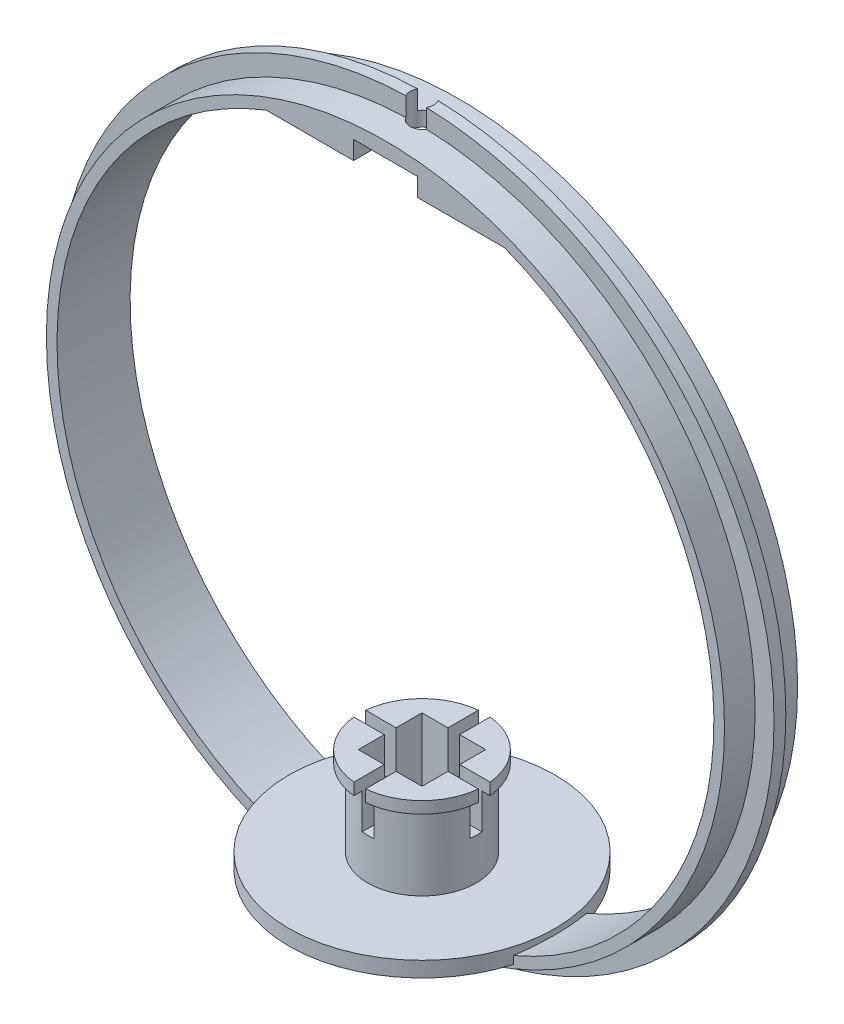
ISO-10303-21;
HEADER;
FILE_DESCRIPTION(('STEP AP214'),'2;1');
FILE_NAME('part.step','',(''),(''),'','','');
FILE_SCHEMA(('AUTOMOTIVE_DESIGN { 1 0 10303 214 1 1 1 1 }'));
ENDSEC;
DATA;
#1=APPLICATION_CONTEXT('core data for automotive mechanical design processes');
#2=APPLICATION_PROTOCOL_DEFINITION('international standard','automotive_design',2000,#1);
#3=PRODUCT_CONTEXT('',#1,'mechanical');
#4=PRODUCT('Part','Part','',(#3));
#5=PRODUCT_RELATED_PRODUCT_CATEGORY('part','',(#4));
#6=PRODUCT_DEFINITION_FORMATION('','',#4);
#7=PRODUCT_DEFINITION_CONTEXT('part definition',#1,'design');
#8=PRODUCT_DEFINITION('design','',#6,#7);
#9=PRODUCT_DEFINITION_SHAPE('','',#8);
#10=(LENGTH_UNIT() NAMED_UNIT(*) SI_UNIT(.MILLI.,.METRE.));
#11=(NAMED_UNIT(*) PLANE_ANGLE_UNIT() SI_UNIT($,.RADIAN.));
#12=(NAMED_UNIT(*) SI_UNIT($,.STERADIAN.) SOLID_ANGLE_UNIT());
#13=UNCERTAINTY_MEASURE_WITH_UNIT(LENGTH_MEASURE(1.E-05),#10,'distance_accuracy_value','');
#14=(GEOMETRIC_REPRESENTATION_CONTEXT(3) GLOBAL_UNCERTAINTY_ASSIGNED_CONTEXT((#13)) GLOBAL_UNIT_ASSIGNED_CONTEXT((#10,
#11,#12)) REPRESENTATION_CONTEXT('',''));
#15=CARTESIAN_POINT('',(0.,0.,0.));
#16=DIRECTION('',(0.,0.,1.));
#17=DIRECTION('',(1.,0.,0.));
#18=AXIS2_PLACEMENT_3D('',#15,#16,#17);
#19=CARTESIAN_POINT('',(0.,-27.9275,0.));
#20=DIRECTION('',(0.,1.,0.));
#21=DIRECTION('',(0.,0.,1.));
#22=AXIS2_PLACEMENT_3D('',#19,#20,#21);
#23=CYLINDRICAL_SURFACE('',#22,3.1);
#24=CARTESIAN_POINT('',(0.,-26.3,0.));
#25=DIRECTION('',(0.,1.,0.));
#26=DIRECTION('',(0.,0.,1.));
#27=AXIS2_PLACEMENT_3D('',#24,#25,#26);
#28=CIRCLE('',#27,3.1);
#29=CARTESIAN_POINT('',(-1.52315462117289,-26.3,2.7));
#30=VERTEX_POINT('',#29);
#31=CARTESIAN_POINT('',(1.52315462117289,-26.3,2.7));
#32=VERTEX_POINT('',#31);
#33=EDGE_CURVE('E1001',#30,#32,#28,.T.);
#34=ORIENTED_EDGE('',*,*,#33,.T.);
#35=CARTESIAN_POINT('',(0.,-26.3,0.));
#36=DIRECTION('',(0.,1.,0.));
#37=DIRECTION('',(0.,0.,1.));
#38=AXIS2_PLACEMENT_3D('',#35,#36,#37);
#39=CIRCLE('',#38,3.1);
#40=CARTESIAN_POINT('',(2.7,-26.3,1.52315462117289));
#41=VERTEX_POINT('',#40);
#42=EDGE_CURVE('E1388',#41,#32,#39,.F.);
#43=ORIENTED_EDGE('',*,*,#42,.F.);
#44=CARTESIAN_POINT('',(0.,-26.3,0.));
#45=DIRECTION('',(0.,1.,0.));
#46=DIRECTION('',(0.,0.,1.));
#47=AXIS2_PLACEMENT_3D('',#44,#45,#46);
#48=CIRCLE('',#47,3.1);
#49=CARTESIAN_POINT('',(2.7,-26.3,-1.52315462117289));
#50=VERTEX_POINT('',#49);
#51=EDGE_CURVE('E996',#41,#50,#48,.T.);
#52=ORIENTED_EDGE('',*,*,#51,.T.);
#53=CARTESIAN_POINT('',(0.,-26.3,0.));
#54=DIRECTION('',(0.,1.,0.));
#55=DIRECTION('',(0.,0.,1.));
#56=AXIS2_PLACEMENT_3D('',#53,#54,#55);
#57=CIRCLE('',#56,3.1);
#58=CARTESIAN_POINT('',(1.52315462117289,-26.3,-2.7));
#59=VERTEX_POINT('',#58);
#60=EDGE_CURVE('E993',#59,#50,#57,.F.);
#61=ORIENTED_EDGE('',*,*,#60,.F.);
#62=CARTESIAN_POINT('',(0.,-26.3,0.));
#63=DIRECTION('',(0.,1.,0.));
#64=DIRECTION('',(0.,0.,1.));
#65=AXIS2_PLACEMENT_3D('',#62,#63,#64);
#66=CIRCLE('',#65,3.1);
#67=CARTESIAN_POINT('',(-1.52315462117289,-26.3,-2.7));
#68=VERTEX_POINT('',#67);
#69=EDGE_CURVE('E988',#59,#68,#66,.T.);
#70=ORIENTED_EDGE('',*,*,#69,.T.);
#71=CARTESIAN_POINT('',(0.,-26.3,0.));
#72=DIRECTION('',(0.,1.,0.));
#73=DIRECTION('',(0.,0.,1.));
#74=AXIS2_PLACEMENT_3D('',#71,#72,#73);
#75=CIRCLE('',#74,3.1);
#76=CARTESIAN_POINT('',(-2.7,-26.3,-1.52315462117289));
#77=VERTEX_POINT('',#76);
#78=EDGE_CURVE('E977',#77,#68,#75,.F.);
#79=ORIENTED_EDGE('',*,*,#78,.F.);
#80=CARTESIAN_POINT('',(0.,-26.3,0.));
#81=DIRECTION('',(0.,1.,0.));
#82=DIRECTION('',(0.,0.,1.));
#83=AXIS2_PLACEMENT_3D('',#80,#81,#82);
#84=CIRCLE('',#83,3.1);
#85=CARTESIAN_POINT('',(-2.7,-26.3,1.52315462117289));
#86=VERTEX_POINT('',#85);
#87=EDGE_CURVE('E288',#77,#86,#84,.T.);
#88=ORIENTED_EDGE('',*,*,#87,.T.);
#89=CARTESIAN_POINT('',(0.,-26.3,0.));
#90=DIRECTION('',(0.,1.,0.));
#91=DIRECTION('',(0.,0.,1.));
#92=AXIS2_PLACEMENT_3D('',#89,#90,#91);
#93=CIRCLE('',#92,3.1);
#94=EDGE_CURVE('E999',#30,#86,#93,.F.);
#95=ORIENTED_EDGE('',*,*,#94,.F.);
#96=EDGE_LOOP('',(#34,#43,#52,#61,#70,#79,#88,#95));
#97=FACE_BOUND('',#96,.T.);
#98=CARTESIAN_POINT('',(0.,-27.85,3.1));
#99=CARTESIAN_POINT('',(-0.173396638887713,-27.8499978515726,3.09999245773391));
#100=CARTESIAN_POINT('',(-0.347021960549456,-27.8483622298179,3.08539145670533));
#101=CARTESIAN_POINT('',(-0.689569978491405,-27.841991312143,3.02733931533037));
#102=CARTESIAN_POINT('',(-0.858482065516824,-27.8372495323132,2.98382782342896));
#103=CARTESIAN_POINT('',(-1.1864181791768,-27.8252008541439,2.86923830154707));
#104=CARTESIAN_POINT('',(-1.34545211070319,-27.8178965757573,2.79818841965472));
#105=CARTESIAN_POINT('',(-1.64926233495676,-27.8015396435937,2.63059462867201));
#106=CARTESIAN_POINT('',(-1.79404468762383,-27.7924877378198,2.53406162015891));
#107=CARTESIAN_POINT('',(-2.06597636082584,-27.773601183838,2.31776669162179));
#108=CARTESIAN_POINT('',(-2.19305234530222,-27.7637635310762,2.19791281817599));
#109=CARTESIAN_POINT('',(-2.4253359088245,-27.7444384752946,1.93856997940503));
#110=CARTESIAN_POINT('',(-2.53054135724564,-27.7349511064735,1.7990791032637));
#111=CARTESIAN_POINT('',(-2.71634769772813,-27.7173721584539,1.50397334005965));
#112=CARTESIAN_POINT('',(-2.79688323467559,-27.7092843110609,1.34831706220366));
#113=CARTESIAN_POINT('',(-2.93064530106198,-27.6954575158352,1.02558623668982));
#114=CARTESIAN_POINT('',(-2.98387289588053,-27.689718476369,0.858512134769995));
#115=CARTESIAN_POINT('',(-3.06129460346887,-27.6812662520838,0.518423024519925));
#116=CARTESIAN_POINT('',(-3.08560842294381,-27.6785405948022,0.34543558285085));
#117=CARTESIAN_POINT('',(-3.10488257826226,-27.6763853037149,-0.00218470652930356));
#118=CARTESIAN_POINT('',(-3.09984380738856,-27.676955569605,-0.176817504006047));
#119=CARTESIAN_POINT('',(-3.06065438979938,-27.6813162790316,-0.521940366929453));
#120=CARTESIAN_POINT('',(-3.02663520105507,-27.6850921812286,-0.692445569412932));
#121=CARTESIAN_POINT('',(-2.93065488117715,-27.695416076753,-1.02531310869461));
#122=CARTESIAN_POINT('',(-2.86869304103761,-27.70196414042,-1.18767523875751));
#123=CARTESIAN_POINT('',(-2.71844037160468,-27.7171114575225,-1.5000636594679));
#124=CARTESIAN_POINT('',(-2.63009083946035,-27.7257152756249,-1.65006148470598));
#125=CARTESIAN_POINT('',(-2.42962057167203,-27.7440000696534,-1.9331382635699));
#126=CARTESIAN_POINT('',(-2.31750092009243,-27.7536809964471,-2.0662179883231));
#127=CARTESIAN_POINT('',(-2.07196388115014,-27.7730927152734,-2.31243472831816));
#128=CARTESIAN_POINT('',(-1.93843714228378,-27.7828235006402,-2.42546270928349));
#129=CARTESIAN_POINT('',(-1.65417474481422,-27.8011952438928,-2.6275700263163));
#130=CARTESIAN_POINT('',(-1.50343119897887,-27.8098356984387,-2.7166383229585));
#131=CARTESIAN_POINT('',(-1.18889606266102,-27.8250577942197,-2.86828548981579));
#132=CARTESIAN_POINT('',(-1.02509087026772,-27.8316372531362,-2.9308363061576));
#133=CARTESIAN_POINT('',(-0.689435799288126,-27.8419686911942,-3.02738479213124));
#134=CARTESIAN_POINT('',(-0.517603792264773,-27.845726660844,-3.06144297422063));
#135=CARTESIAN_POINT('',(-0.287177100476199,-27.8485787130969,-3.08720810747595));
#136=CARTESIAN_POINT('',(-0.22985469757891,-27.8491106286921,-3.09200149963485));
#137=CARTESIAN_POINT('',(-0.115029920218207,-27.8498216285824,-3.09839869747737));
#138=CARTESIAN_POINT('',(-0.0575275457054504,-27.8500007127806,-3.10000250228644));
#139=CARTESIAN_POINT('',(0.173396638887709,-27.8499978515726,-3.09999245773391));
#140=CARTESIAN_POINT('',(0.347021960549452,-27.8483622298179,-3.08539145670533));
#141=CARTESIAN_POINT('',(0.689569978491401,-27.841991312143,-3.02733931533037));
#142=CARTESIAN_POINT('',(0.85848206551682,-27.8372495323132,-2.98382782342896));
#143=CARTESIAN_POINT('',(1.1864181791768,-27.8252008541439,-2.86923830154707));
#144=CARTESIAN_POINT('',(1.34545211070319,-27.8178965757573,-2.79818841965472));
#145=CARTESIAN_POINT('',(1.64926233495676,-27.8015396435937,-2.63059462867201));
#146=CARTESIAN_POINT('',(1.79404468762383,-27.7924877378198,-2.53406162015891));
#147=CARTESIAN_POINT('',(2.06597636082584,-27.773601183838,-2.31776669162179));
#148=CARTESIAN_POINT('',(2.19305234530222,-27.7637635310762,-2.19791281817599));
#149=CARTESIAN_POINT('',(2.4253359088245,-27.7444384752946,-1.93856997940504));
#150=CARTESIAN_POINT('',(2.53054135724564,-27.7349511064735,-1.7990791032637));
#151=CARTESIAN_POINT('',(2.71634769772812,-27.7173721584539,-1.50397334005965));
#152=CARTESIAN_POINT('',(2.79688323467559,-27.7092843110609,-1.34831706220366));
#153=CARTESIAN_POINT('',(2.93064530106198,-27.6954575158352,-1.02558623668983));
#154=CARTESIAN_POINT('',(2.98387289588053,-27.689718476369,-0.858512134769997));
#155=CARTESIAN_POINT('',(3.06129460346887,-27.6812662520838,-0.518423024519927));
#156=CARTESIAN_POINT('',(3.08560842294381,-27.6785405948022,-0.345435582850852));
#157=CARTESIAN_POINT('',(3.10488257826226,-27.6763853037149,0.00218470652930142));
#158=CARTESIAN_POINT('',(3.09984380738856,-27.676955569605,0.176817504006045));
#159=CARTESIAN_POINT('',(3.06065438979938,-27.6813162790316,0.52194036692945));
#160=CARTESIAN_POINT('',(3.02663520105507,-27.6850921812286,0.69244556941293));
#161=CARTESIAN_POINT('',(2.93065488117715,-27.695416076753,1.02531310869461));
#162=CARTESIAN_POINT('',(2.86869304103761,-27.70196414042,1.18767523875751));
#163=CARTESIAN_POINT('',(2.71844037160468,-27.7171114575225,1.50006365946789));
#164=CARTESIAN_POINT('',(2.63009083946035,-27.7257152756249,1.65006148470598));
#165=CARTESIAN_POINT('',(2.42962057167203,-27.7440000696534,1.9331382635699));
#166=CARTESIAN_POINT('',(2.31750092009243,-27.7536809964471,2.0662179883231));
#167=CARTESIAN_POINT('',(2.07196388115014,-27.7730927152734,2.31243472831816));
#168=CARTESIAN_POINT('',(1.93843714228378,-27.7828235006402,2.42546270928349));
#169=CARTESIAN_POINT('',(1.65417474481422,-27.8011952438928,2.6275700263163));
#170=CARTESIAN_POINT('',(1.50343119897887,-27.8098356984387,2.7166383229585));
#171=CARTESIAN_POINT('',(1.18889606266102,-27.8250577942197,2.86828548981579));
#172=CARTESIAN_POINT('',(1.02509087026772,-27.8316372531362,2.9308363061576));
#173=CARTESIAN_POINT('',(0.689435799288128,-27.8419686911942,3.02738479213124));
#174=CARTESIAN_POINT('',(0.517603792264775,-27.845726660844,3.06144297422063));
#175=CARTESIAN_POINT('',(0.287177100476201,-27.8485787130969,3.08720810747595));
#176=CARTESIAN_POINT('',(0.229854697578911,-27.8491106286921,3.09200149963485));
#177=CARTESIAN_POINT('',(0.115029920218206,-27.8498216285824,3.09839869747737));
#178=CARTESIAN_POINT('',(0.0575275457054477,-27.8500007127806,3.10000250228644));
#179=CARTESIAN_POINT('',(0.,-27.85,3.1));
#180=B_SPLINE_CURVE_WITH_KNOTS('',3,(#98,#99,#100,#101,#102,#103,#104,#105,#106,#107,#108,#109,
#110,#111,#112,#113,#114,#115,#116,#117,#118,#119,#120,#121,#122,#123,#124,#125,#126,#127,#128,
#129,#130,#131,#132,#133,#134,#135,#136,#137,#138,#139,#140,#141,#142,#143,#144,#145,#146,#147,
#148,#149,#150,#151,#152,#153,#154,#155,#156,#157,#158,#159,#160,#161,#162,#163,#164,#165,#166,
#167,#168,#169,#170,#171,#172,#173,#174,#175,#176,#177,#178,#179),.UNSPECIFIED.,.T.,.F.,(4,2,2,
2,2,2,2,2,2,2,2,2,2,2,2,2,2,2,2,2,2,2,2,2,2,2,2,2,2,2,2,2,2,2,2,2,2,2,2,2,4),(0.,
0.519970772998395,1.04103042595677,1.56155888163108,2.08186503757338,2.60426591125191,
3.12671765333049,3.65054172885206,4.17434536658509,4.69597275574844,5.21758427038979,
5.73684222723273,6.25611336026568,6.77654839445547,7.29695969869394,7.82011942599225,
8.34351978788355,8.86747250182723,9.390309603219,9.56281948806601,9.73532942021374,
10.2553001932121,10.7763598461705,11.2968883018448,11.8171944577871,12.3395953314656,
12.8620470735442,13.3858711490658,13.9096747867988,14.4313021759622,14.9529136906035,
15.4721716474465,15.9914427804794,16.5118778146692,17.0322891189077,17.555448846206,
18.0788492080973,18.602801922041,19.1256390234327,19.2981489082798,19.4706588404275),.UNSPECIFIED.);
#181=CARTESIAN_POINT('',(0.,-27.85,3.1));
#182=VERTEX_POINT('',#181);
#183=EDGE_CURVE('E883',#182,#182,#180,.T.);
#184=ORIENTED_EDGE('',*,*,#183,.T.);
#185=EDGE_LOOP('',(#184));
#186=FACE_BOUND('',#185,.T.);
#187=ADVANCED_FACE('F16',(#97,#186),#23,.F.);
#188=CARTESIAN_POINT('',(0.,-26.3,0.));
#189=DIRECTION('',(0.,1.,0.));
#190=DIRECTION('',(0.,0.,1.));
#191=AXIS2_PLACEMENT_3D('',#188,#189,#190);
#192=PLANE('',#191);
#193=ORIENTED_EDGE('',*,*,#87,.F.);
#194=DIRECTION('',(0.,0.,1.));
#195=VECTOR('',#194,1.);
#196=CARTESIAN_POINT('',(-2.7,-26.3,-2.7));
#197=LINE('',#196,#195);
#198=EDGE_CURVE('E929',#77,#86,#197,.T.);
#199=ORIENTED_EDGE('',*,*,#198,.T.);
#200=EDGE_LOOP('',(#193,#199));
#201=FACE_BOUND('',#200,.T.);
#202=ADVANCED_FACE('F966',(#201),#192,.F.);
#203=CARTESIAN_POINT('',(0.,-26.3,0.));
#204=DIRECTION('',(0.,1.,0.));
#205=DIRECTION('',(0.,0.,1.));
#206=AXIS2_PLACEMENT_3D('',#203,#204,#205);
#207=PLANE('',#206);
#208=ORIENTED_EDGE('',*,*,#69,.F.);
#209=DIRECTION('',(-1.,0.,0.));
#210=VECTOR('',#209,1.);
#211=CARTESIAN_POINT('',(2.7,-26.3,-2.7));
#212=LINE('',#211,#210);
#213=EDGE_CURVE('E939',#59,#68,#212,.T.);
#214=ORIENTED_EDGE('',*,*,#213,.T.);
#215=EDGE_LOOP('',(#208,#214));
#216=FACE_BOUND('',#215,.T.);
#217=ADVANCED_FACE('F987',(#216),#207,.F.);
#218=CARTESIAN_POINT('',(0.,-26.3,0.));
#219=DIRECTION('',(0.,1.,0.));
#220=DIRECTION('',(0.,0.,1.));
#221=AXIS2_PLACEMENT_3D('',#218,#219,#220);
#222=PLANE('',#221);
#223=ORIENTED_EDGE('',*,*,#78,.T.);
#224=DIRECTION('',(-1.,0.,0.));
#225=VECTOR('',#224,1.);
#226=CARTESIAN_POINT('',(2.7,-26.3,-2.7));
#227=LINE('',#226,#225);
#228=CARTESIAN_POINT('',(-2.7,-26.3,-2.7));
#229=VERTEX_POINT('',#228);
#230=EDGE_CURVE('E950',#68,#229,#227,.T.);
#231=ORIENTED_EDGE('',*,*,#230,.T.);
#232=DIRECTION('',(0.,0.,1.));
#233=VECTOR('',#232,1.);
#234=CARTESIAN_POINT('',(-2.7,-26.3,-2.7));
#235=LINE('',#234,#233);
#236=EDGE_CURVE('E953',#229,#77,#235,.T.);
#237=ORIENTED_EDGE('',*,*,#236,.T.);
#238=EDGE_LOOP('',(#223,#231,#237));
#239=FACE_BOUND('',#238,.T.);
#240=ADVANCED_FACE('F976',(#239),#222,.T.);
#241=CARTESIAN_POINT('',(0.,-26.3,0.));
#242=DIRECTION('',(0.,1.,0.));
#243=DIRECTION('',(0.,0.,1.));
#244=AXIS2_PLACEMENT_3D('',#241,#242,#243);
#245=PLANE('',#244);
#246=ORIENTED_EDGE('',*,*,#51,.F.);
#247=DIRECTION('',(0.,0.,-1.));
#248=VECTOR('',#247,1.);
#249=CARTESIAN_POINT('',(2.7,-26.3,2.7));
#250=LINE('',#249,#248);
#251=EDGE_CURVE('E913',#41,#50,#250,.T.);
#252=ORIENTED_EDGE('',*,*,#251,.T.);
#253=EDGE_LOOP('',(#246,#252));
#254=FACE_BOUND('',#253,.T.);
#255=ADVANCED_FACE('F1346',(#254),#245,.F.);
#256=CARTESIAN_POINT('',(0.,-26.3,0.));
#257=DIRECTION('',(0.,1.,0.));
#258=DIRECTION('',(0.,0.,1.));
#259=AXIS2_PLACEMENT_3D('',#256,#257,#258);
#260=PLANE('',#259);
#261=DIRECTION('',(0.,0.,-1.));
#262=VECTOR('',#261,1.);
#263=CARTESIAN_POINT('',(2.7,-26.3,2.7));
#264=LINE('',#263,#262);
#265=CARTESIAN_POINT('',(2.7,-26.3,-2.7));
#266=VERTEX_POINT('',#265);
#267=EDGE_CURVE('E934',#50,#266,#264,.T.);
#268=ORIENTED_EDGE('',*,*,#267,.T.);
#269=DIRECTION('',(-1.,0.,0.));
#270=VECTOR('',#269,1.);
#271=CARTESIAN_POINT('',(2.7,-26.3,-2.7));
#272=LINE('',#271,#270);
#273=EDGE_CURVE('E849',#266,#59,#272,.T.);
#274=ORIENTED_EDGE('',*,*,#273,.T.);
#275=ORIENTED_EDGE('',*,*,#60,.T.);
#276=EDGE_LOOP('',(#268,#274,#275));
#277=FACE_BOUND('',#276,.T.);
#278=ADVANCED_FACE('F1339',(#277),#260,.T.);
#279=CARTESIAN_POINT('',(0.,-26.3,0.));
#280=DIRECTION('',(0.,1.,0.));
#281=DIRECTION('',(0.,0.,1.));
#282=AXIS2_PLACEMENT_3D('',#279,#280,#281);
#283=PLANE('',#282);
#284=ORIENTED_EDGE('',*,*,#94,.T.);
#285=DIRECTION('',(0.,0.,1.));
#286=VECTOR('',#285,1.);
#287=CARTESIAN_POINT('',(-2.7,-26.3,-2.7));
#288=LINE('',#287,#286);
#289=CARTESIAN_POINT('',(-2.7,-26.3,2.7));
#290=VERTEX_POINT('',#289);
#291=EDGE_CURVE('E877',#86,#290,#288,.T.);
#292=ORIENTED_EDGE('',*,*,#291,.T.);
#293=DIRECTION('',(1.,0.,0.));
#294=VECTOR('',#293,1.);
#295=CARTESIAN_POINT('',(-2.7,-26.3,2.7));
#296=LINE('',#295,#294);
#297=EDGE_CURVE('E754',#290,#30,#296,.T.);
#298=ORIENTED_EDGE('',*,*,#297,.T.);
#299=EDGE_LOOP('',(#284,#292,#298));
#300=FACE_BOUND('',#299,.T.);
#301=ADVANCED_FACE('F1018',(#300),#283,.T.);
#302=CARTESIAN_POINT('',(0.,-26.3,0.));
#303=DIRECTION('',(0.,1.,0.));
#304=DIRECTION('',(0.,0.,1.));
#305=AXIS2_PLACEMENT_3D('',#302,#303,#304);
#306=PLANE('',#305);
#307=DIRECTION('',(1.,0.,0.));
#308=VECTOR('',#307,1.);
#309=CARTESIAN_POINT('',(-2.7,-26.3,2.7));
#310=LINE('',#309,#308);
#311=EDGE_CURVE('E918',#30,#32,#310,.T.);
#312=ORIENTED_EDGE('',*,*,#311,.T.);
#313=ORIENTED_EDGE('',*,*,#33,.F.);
#314=EDGE_LOOP('',(#312,#313));
#315=FACE_BOUND('',#314,.T.);
#316=ADVANCED_FACE('F1325',(#315),#306,.F.);
#317=CARTESIAN_POINT('',(0.,-26.3,0.));
#318=DIRECTION('',(0.,1.,0.));
#319=DIRECTION('',(0.,0.,1.));
#320=AXIS2_PLACEMENT_3D('',#317,#318,#319);
#321=PLANE('',#320);
#322=ORIENTED_EDGE('',*,*,#42,.T.);
#323=DIRECTION('',(1.,0.,0.));
#324=VECTOR('',#323,1.);
#325=CARTESIAN_POINT('',(-2.7,-26.3,2.7));
#326=LINE('',#325,#324);
#327=CARTESIAN_POINT('',(2.7,-26.3,2.7));
#328=VERTEX_POINT('',#327);
#329=EDGE_CURVE('E903',#32,#328,#326,.T.);
#330=ORIENTED_EDGE('',*,*,#329,.T.);
#331=DIRECTION('',(0.,0.,-1.));
#332=VECTOR('',#331,1.);
#333=CARTESIAN_POINT('',(2.7,-26.3,2.7));
#334=LINE('',#333,#332);
#335=EDGE_CURVE('E910',#328,#41,#334,.T.);
#336=ORIENTED_EDGE('',*,*,#335,.T.);
#337=EDGE_LOOP('',(#322,#330,#336));
#338=FACE_BOUND('',#337,.T.);
#339=ADVANCED_FACE('F1318',(#338),#321,.T.);
#340=CARTESIAN_POINT('',(0.,0.,-10.75083697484));
#341=DIRECTION('',(0.,0.,1.));
#342=DIRECTION('',(1.,0.,0.));
#343=AXIS2_PLACEMENT_3D('',#340,#341,#342);
#344=CYLINDRICAL_SURFACE('',#343,27.85);
#345=CARTESIAN_POINT('',(0.,-27.85,1.));
#346=CARTESIAN_POINT('',(-0.0561184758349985,-27.8499996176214,0.999995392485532));
#347=CARTESIAN_POINT('',(-0.11228741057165,-27.8498284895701,0.995258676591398));
#348=CARTESIAN_POINT('',(-0.223125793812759,-27.8491616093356,0.97641523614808));
#349=CARTESIAN_POINT('',(-0.277791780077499,-27.8486651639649,0.962288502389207));
#350=CARTESIAN_POINT('',(-0.383932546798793,-27.8474040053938,0.925069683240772));
#351=CARTESIAN_POINT('',(-0.435410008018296,-27.8466395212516,0.901985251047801));
#352=CARTESIAN_POINT('',(-0.533732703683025,-27.8449286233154,0.847518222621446));
#353=CARTESIAN_POINT('',(-0.580580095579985,-27.8439822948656,0.816139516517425));
#354=CARTESIAN_POINT('',(-0.668372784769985,-27.8420134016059,0.745947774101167));
#355=CARTESIAN_POINT('',(-0.709314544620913,-27.8409907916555,0.707130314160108));
#356=CARTESIAN_POINT('',(-0.784105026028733,-27.8389849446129,0.623169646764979));
#357=CARTESIAN_POINT('',(-0.817953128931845,-27.8380017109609,0.578025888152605));
#358=CARTESIAN_POINT('',(-0.877598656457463,-27.8361853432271,0.482683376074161));
#359=CARTESIAN_POINT('',(-0.903394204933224,-27.835352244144,0.43248344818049));
#360=CARTESIAN_POINT('',(-0.946189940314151,-27.8339304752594,0.328462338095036));
#361=CARTESIAN_POINT('',(-0.963190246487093,-27.8333418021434,0.274641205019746));
#362=CARTESIAN_POINT('',(-0.987906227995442,-27.8324755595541,0.164929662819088));
#363=CARTESIAN_POINT('',(-0.995625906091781,-27.8321978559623,0.109040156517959));
#364=CARTESIAN_POINT('',(-1.00157383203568,-27.8319844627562,-0.00324220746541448));
#365=CARTESIAN_POINT('',(-0.999802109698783,-27.8320487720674,-0.0596350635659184));
#366=CARTESIAN_POINT('',(-0.986820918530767,-27.8325120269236,-0.171295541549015));
#367=CARTESIAN_POINT('',(-0.975615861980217,-27.832910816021,-0.226563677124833));
#368=CARTESIAN_POINT('',(-0.944092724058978,-27.8339978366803,-0.334434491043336));
#369=CARTESIAN_POINT('',(-0.923774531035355,-27.8346860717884,-0.387037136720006));
#370=CARTESIAN_POINT('',(-0.874595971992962,-27.8362746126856,-0.48809915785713));
#371=CARTESIAN_POINT('',(-0.84573328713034,-27.8371749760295,-0.536557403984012));
#372=CARTESIAN_POINT('',(-0.780289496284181,-27.8390861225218,-0.627938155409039));
#373=CARTESIAN_POINT('',(-0.743709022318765,-27.8400968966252,-0.670861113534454));
#374=CARTESIAN_POINT('',(-0.663850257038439,-27.8421154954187,-0.749975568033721));
#375=CARTESIAN_POINT('',(-0.620569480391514,-27.8431233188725,-0.786164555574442));
#376=CARTESIAN_POINT('',(-0.528522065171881,-27.8450225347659,-0.850780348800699));
#377=CARTESIAN_POINT('',(-0.479752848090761,-27.845913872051,-0.879203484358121));
#378=CARTESIAN_POINT('',(-0.378094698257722,-27.847479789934,-0.927477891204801));
#379=CARTESIAN_POINT('',(-0.325202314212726,-27.8481541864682,-0.947321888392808));
#380=CARTESIAN_POINT('',(-0.216920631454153,-27.8492075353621,-0.977802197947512));
#381=CARTESIAN_POINT('',(-0.161536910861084,-27.8495871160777,-0.988458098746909));
#382=CARTESIAN_POINT('',(-0.0705936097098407,-27.8499328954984,-0.998132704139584));
#383=CARTESIAN_POINT('',(-0.0353067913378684,-27.8500002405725,-1.0000028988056));
#384=CARTESIAN_POINT('',(0.0561184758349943,-27.8499996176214,-0.999995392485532));
#385=CARTESIAN_POINT('',(0.112287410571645,-27.8498284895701,-0.995258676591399));
#386=CARTESIAN_POINT('',(0.223125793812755,-27.8491616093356,-0.976415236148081));
#387=CARTESIAN_POINT('',(0.277791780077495,-27.8486651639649,-0.962288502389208));
#388=CARTESIAN_POINT('',(0.383932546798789,-27.8474040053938,-0.925069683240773));
#389=CARTESIAN_POINT('',(0.435410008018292,-27.8466395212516,-0.901985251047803));
#390=CARTESIAN_POINT('',(0.533732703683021,-27.8449286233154,-0.847518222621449));
#391=CARTESIAN_POINT('',(0.580580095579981,-27.8439822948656,-0.816139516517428));
#392=CARTESIAN_POINT('',(0.668372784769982,-27.8420134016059,-0.745947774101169));
#393=CARTESIAN_POINT('',(0.70931454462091,-27.8409907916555,-0.70713031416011));
#394=CARTESIAN_POINT('',(0.784105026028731,-27.8389849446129,-0.623169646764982));
#395=CARTESIAN_POINT('',(0.817953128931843,-27.8380017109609,-0.578025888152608));
#396=CARTESIAN_POINT('',(0.877598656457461,-27.8361853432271,-0.482683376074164));
#397=CARTESIAN_POINT('',(0.903394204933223,-27.835352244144,-0.432483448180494));
#398=CARTESIAN_POINT('',(0.94618994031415,-27.8339304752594,-0.32846233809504));
#399=CARTESIAN_POINT('',(0.963190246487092,-27.8333418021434,-0.274641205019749));
#400=CARTESIAN_POINT('',(0.987906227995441,-27.8324755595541,-0.164929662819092));
#401=CARTESIAN_POINT('',(0.995625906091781,-27.8321978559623,-0.109040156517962));
#402=CARTESIAN_POINT('',(1.00157383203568,-27.8319844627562,0.00324220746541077));
#403=CARTESIAN_POINT('',(0.999802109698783,-27.8320487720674,0.0596350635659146));
#404=CARTESIAN_POINT('',(0.986820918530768,-27.8325120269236,0.171295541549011));
#405=CARTESIAN_POINT('',(0.975615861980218,-27.832910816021,0.226563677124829));
#406=CARTESIAN_POINT('',(0.944092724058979,-27.8339978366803,0.334434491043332));
#407=CARTESIAN_POINT('',(0.923774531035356,-27.8346860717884,0.387037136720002));
#408=CARTESIAN_POINT('',(0.874595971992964,-27.8362746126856,0.488099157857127));
#409=CARTESIAN_POINT('',(0.845733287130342,-27.8371749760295,0.536557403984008));
#410=CARTESIAN_POINT('',(0.780289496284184,-27.8390861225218,0.627938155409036));
#411=CARTESIAN_POINT('',(0.743709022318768,-27.8400968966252,0.670861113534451));
#412=CARTESIAN_POINT('',(0.663850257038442,-27.8421154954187,0.749975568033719));
#413=CARTESIAN_POINT('',(0.620569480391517,-27.8431233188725,0.78616455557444));
#414=CARTESIAN_POINT('',(0.528522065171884,-27.8450225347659,0.850780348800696));
#415=CARTESIAN_POINT('',(0.479752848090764,-27.845913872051,0.879203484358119));
#416=CARTESIAN_POINT('',(0.378094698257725,-27.847479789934,0.927477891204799));
#417=CARTESIAN_POINT('',(0.32520231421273,-27.8481541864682,0.947321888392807));
#418=CARTESIAN_POINT('',(0.216920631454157,-27.8492075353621,0.977802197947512));
#419=CARTESIAN_POINT('',(0.161536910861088,-27.8495871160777,0.988458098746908));
#420=CARTESIAN_POINT('',(0.0705936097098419,-27.8499328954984,0.998132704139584));
#421=CARTESIAN_POINT('',(0.0353067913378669,-27.8500002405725,1.0000028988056));
#422=CARTESIAN_POINT('',(0.,-27.85,1.));
#423=B_SPLINE_CURVE_WITH_KNOTS('',3,(#345,#346,#347,#348,#349,#350,#351,#352,#353,#354,#355,
#356,#357,#358,#359,#360,#361,#362,#363,#364,#365,#366,#367,#368,#369,#370,#371,#372,#373,#374,
#375,#376,#377,#378,#379,#380,#381,#382,#383,#384,#385,#386,#387,#388,#389,#390,#391,#392,#393,
#394,#395,#396,#397,#398,#399,#400,#401,#402,#403,#404,#405,#406,#407,#408,#409,#410,#411,#412,
#413,#414,#415,#416,#417,#418,#419,#420,#421,#422),.UNSPECIFIED.,.T.,.F.,(4,2,2,2,2,2,2,2,2,2,2,
2,2,2,2,2,2,2,2,2,2,2,2,2,2,2,2,2,2,2,2,2,2,2,2,2,2,2,4),(0.,0.168244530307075,0.33684872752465,
0.505309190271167,0.673690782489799,0.842172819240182,1.01066954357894,1.17920549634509,
1.34773916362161,1.51620011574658,1.68466053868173,1.85304221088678,2.02142594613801,
2.18985542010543,2.35827110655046,2.52674941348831,2.69530720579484,2.86400763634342,
3.0323475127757,3.13819811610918,3.30644264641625,3.47504684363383,3.64350730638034,
3.81188889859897,3.98037093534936,4.14886765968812,4.31740361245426,4.48593727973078,
4.65439823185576,4.82285865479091,4.99124032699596,5.15962406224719,5.3280535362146,
5.49646922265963,5.66494752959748,5.83350532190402,6.00220575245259,6.17054562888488,
6.27639623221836),.UNSPECIFIED.);
#424=CARTESIAN_POINT('',(0.,-27.85,1.));
#425=VERTEX_POINT('',#424);
#426=EDGE_CURVE('E384',#425,#425,#423,.T.);
#427=ORIENTED_EDGE('',*,*,#426,.T.);
#428=EDGE_LOOP('',(#427));
#429=FACE_BOUND('',#428,.T.);
#430=ORIENTED_EDGE('',*,*,#183,.F.);
#431=EDGE_LOOP('',(#430));
#432=FACE_BOUND('',#431,.T.);
#433=ADVANCED_FACE('F1311',(#429,#432),#344,.F.);
#434=CARTESIAN_POINT('',(0.,-18.5,0.));
#435=DIRECTION('',(0.,1.,0.));
#436=DIRECTION('',(0.,0.,1.));
#437=AXIS2_PLACEMENT_3D('',#434,#435,#436);
#438=CYLINDRICAL_SURFACE('',#437,5.3);
#439=CARTESIAN_POINT('',(0.,-18.5,0.));
#440=DIRECTION('',(0.,1.,0.));
#441=DIRECTION('',(0.,0.,1.));
#442=AXIS2_PLACEMENT_3D('',#439,#440,#441);
#443=CIRCLE('',#442,5.3);
#444=CARTESIAN_POINT('',(-5.27636238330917,-18.5,0.500000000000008));
#445=VERTEX_POINT('',#444);
#446=CARTESIAN_POINT('',(-0.5,-18.5,5.27636238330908));
#447=VERTEX_POINT('',#446);
#448=EDGE_CURVE('E702',#445,#447,#443,.T.);
#449=ORIENTED_EDGE('',*,*,#448,.T.);
#450=DIRECTION('',(0.,1.,0.));
#451=VECTOR('',#450,1.);
#452=CARTESIAN_POINT('',(-0.5,-17.5,5.276362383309));
#453=LINE('',#452,#451);
#454=CARTESIAN_POINT('',(-0.5,-17.5,5.27636238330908));
#455=VERTEX_POINT('',#454);
#456=EDGE_CURVE('E717',#447,#455,#453,.T.);
#457=ORIENTED_EDGE('',*,*,#456,.T.);
#458=CARTESIAN_POINT('',(0.,-17.5,0.));
#459=DIRECTION('',(0.,1.,0.));
#460=DIRECTION('',(0.,0.,1.));
#461=AXIS2_PLACEMENT_3D('',#458,#459,#460);
#462=CIRCLE('',#461,5.3);
#463=CARTESIAN_POINT('',(-5.27636238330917,-17.5,0.500000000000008));
#464=VERTEX_POINT('',#463);
#465=EDGE_CURVE('E882',#464,#455,#462,.T.);
#466=ORIENTED_EDGE('',*,*,#465,.F.);
#467=DIRECTION('',(0.,1.,0.));
#468=VECTOR('',#467,1.);
#469=CARTESIAN_POINT('',(-5.27636238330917,-18.5,0.500000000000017));
#470=LINE('',#469,#468);
#471=EDGE_CURVE('E880',#464,#445,#470,.F.);
#472=ORIENTED_EDGE('',*,*,#471,.T.);
#473=EDGE_LOOP('',(#449,#457,#466,#472));
#474=FACE_BOUND('',#473,.T.);
#475=ADVANCED_FACE('F1036',(#474),#438,.T.);
#476=CARTESIAN_POINT('',(0.,-17.5,0.));
#477=DIRECTION('',(0.,1.,0.));
#478=DIRECTION('',(0.,0.,1.));
#479=AXIS2_PLACEMENT_3D('',#476,#477,#478);
#480=PLANE('',#479);
#481=ORIENTED_EDGE('',*,*,#465,.T.);
#482=DIRECTION('',(0.,0.,1.));
#483=VECTOR('',#482,1.);
#484=CARTESIAN_POINT('',(-0.5,-17.5,7.));
#485=LINE('',#484,#483);
#486=CARTESIAN_POINT('',(-0.5,-17.5,2.7));
#487=VERTEX_POINT('',#486);
#488=EDGE_CURVE('E703',#455,#487,#485,.F.);
#489=ORIENTED_EDGE('',*,*,#488,.T.);
#490=DIRECTION('',(1.,0.,0.));
#491=VECTOR('',#490,1.);
#492=CARTESIAN_POINT('',(-2.7,-17.5,2.7));
#493=LINE('',#492,#491);
#494=CARTESIAN_POINT('',(-2.7,-17.5,2.7));
#495=VERTEX_POINT('',#494);
#496=EDGE_CURVE('E894',#487,#495,#493,.F.);
#497=ORIENTED_EDGE('',*,*,#496,.T.);
#498=DIRECTION('',(0.,0.,1.));
#499=VECTOR('',#498,1.);
#500=CARTESIAN_POINT('',(-2.7,-17.5,-2.7));
#501=LINE('',#500,#499);
#502=CARTESIAN_POINT('',(-2.7,-17.5,0.5));
#503=VERTEX_POINT('',#502);
#504=EDGE_CURVE('E859',#495,#503,#501,.F.);
#505=ORIENTED_EDGE('',*,*,#504,.T.);
#506=DIRECTION('',(1.,0.,0.));
#507=VECTOR('',#506,1.);
#508=CARTESIAN_POINT('',(7.,-17.5,0.5));
#509=LINE('',#508,#507);
#510=EDGE_CURVE('E711',#503,#464,#509,.F.);
#511=ORIENTED_EDGE('',*,*,#510,.T.);
#512=EDGE_LOOP('',(#481,#489,#497,#505,#511));
#513=FACE_BOUND('',#512,.T.);
#514=ADVANCED_FACE('F1026',(#513),#480,.T.);
#515=CARTESIAN_POINT('',(-2.7,0.,-2.7));
#516=DIRECTION('',(-1.,0.,0.));
#517=DIRECTION('',(0.,0.,1.));
#518=AXIS2_PLACEMENT_3D('',#515,#516,#517);
#519=PLANE('',#518);
#520=DIRECTION('',(0.,0.,1.));
#521=VECTOR('',#520,1.);
#522=CARTESIAN_POINT('',(-2.7,-17.5,0.));
#523=LINE('',#522,#521);
#524=CARTESIAN_POINT('',(-2.7,-17.5,-0.5));
#525=VERTEX_POINT('',#524);
#526=CARTESIAN_POINT('',(-2.7,-17.5,-2.7));
#527=VERTEX_POINT('',#526);
#528=EDGE_CURVE('E846',#525,#527,#523,.F.);
#529=ORIENTED_EDGE('',*,*,#528,.F.);
#530=DIRECTION('',(0.,1.,0.));
#531=VECTOR('',#530,1.);
#532=CARTESIAN_POINT('',(-2.7,-21.5,-0.5));
#533=LINE('',#532,#531);
#534=CARTESIAN_POINT('',(-2.7,-21.5,-0.5));
#535=VERTEX_POINT('',#534);
#536=EDGE_CURVE('E696',#525,#535,#533,.F.);
#537=ORIENTED_EDGE('',*,*,#536,.T.);
#538=DIRECTION('',(0.,0.,-1.));
#539=VECTOR('',#538,1.);
#540=CARTESIAN_POINT('',(-2.7,-21.5,0.5));
#541=LINE('',#540,#539);
#542=CARTESIAN_POINT('',(-2.7,-21.5,0.5));
#543=VERTEX_POINT('',#542);
#544=EDGE_CURVE('E856',#535,#543,#541,.F.);
#545=ORIENTED_EDGE('',*,*,#544,.T.);
#546=DIRECTION('',(0.,1.,0.));
#547=VECTOR('',#546,1.);
#548=CARTESIAN_POINT('',(-2.7,-17.5,0.5));
#549=LINE('',#548,#547);
#550=EDGE_CURVE('E866',#543,#503,#549,.T.);
#551=ORIENTED_EDGE('',*,*,#550,.T.);
#552=ORIENTED_EDGE('',*,*,#504,.F.);
#553=DIRECTION('',(0.,1.,0.));
#554=VECTOR('',#553,1.);
#555=CARTESIAN_POINT('',(-2.7,0.,2.7));
#556=LINE('',#555,#554);
#557=EDGE_CURVE('E897',#495,#290,#556,.F.);
#558=ORIENTED_EDGE('',*,*,#557,.T.);
#559=ORIENTED_EDGE('',*,*,#291,.F.);
#560=ORIENTED_EDGE('',*,*,#198,.F.);
#561=ORIENTED_EDGE('',*,*,#236,.F.);
#562=DIRECTION('',(0.,1.,0.));
#563=VECTOR('',#562,1.);
#564=CARTESIAN_POINT('',(-2.7,0.,-2.7));
#565=LINE('',#564,#563);
#566=EDGE_CURVE('E832',#229,#527,#565,.T.);
#567=ORIENTED_EDGE('',*,*,#566,.T.);
#568=EDGE_LOOP('',(#529,#537,#545,#551,#552,#558,#559,#560,#561,#567));
#569=FACE_BOUND('',#568,.T.);
#570=ADVANCED_FACE('F973',(#569),#519,.F.);
#571=CARTESIAN_POINT('',(7.,-21.5,0.5));
#572=DIRECTION('',(0.,-1.,0.));
#573=DIRECTION('',(0.,0.,-1.));
#574=AXIS2_PLACEMENT_3D('',#571,#572,#573);
#575=PLANE('',#574);
#576=CARTESIAN_POINT('',(0.,-21.5,0.));
#577=DIRECTION('',(0.,1.,0.));
#578=DIRECTION('',(0.,0.,1.));
#579=AXIS2_PLACEMENT_3D('',#576,#577,#578);
#580=CIRCLE('',#579,4.6);
#581=CARTESIAN_POINT('',(-4.57274534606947,-21.5,0.500000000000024));
#582=VERTEX_POINT('',#581);
#583=CARTESIAN_POINT('',(-4.57274534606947,-21.5,-0.500000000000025));
#584=VERTEX_POINT('',#583);
#585=EDGE_CURVE('E841',#582,#584,#580,.F.);
#586=ORIENTED_EDGE('',*,*,#585,.F.);
#587=DIRECTION('',(1.,0.,0.));
#588=VECTOR('',#587,1.);
#589=CARTESIAN_POINT('',(7.,-21.5,0.5));
#590=LINE('',#589,#588);
#591=EDGE_CURVE('E710',#582,#543,#590,.T.);
#592=ORIENTED_EDGE('',*,*,#591,.T.);
#593=ORIENTED_EDGE('',*,*,#544,.F.);
#594=DIRECTION('',(-1.,0.,0.));
#595=VECTOR('',#594,1.);
#596=CARTESIAN_POINT('',(7.,-21.5,-0.5));
#597=LINE('',#596,#595);
#598=EDGE_CURVE('E692',#535,#584,#597,.T.);
#599=ORIENTED_EDGE('',*,*,#598,.T.);
#600=EDGE_LOOP('',(#586,#592,#593,#599));
#601=FACE_BOUND('',#600,.T.);
#602=ADVANCED_FACE('F1284',(#601),#575,.F.);
#603=CARTESIAN_POINT('',(0.,-18.5,0.));
#604=DIRECTION('',(0.,1.,0.));
#605=DIRECTION('',(0.,0.,1.));
#606=AXIS2_PLACEMENT_3D('',#603,#604,#605);
#607=CYLINDRICAL_SURFACE('',#606,5.3);
#608=CARTESIAN_POINT('',(0.,-17.5,0.));
#609=DIRECTION('',(0.,1.,0.));
#610=DIRECTION('',(0.,0.,1.));
#611=AXIS2_PLACEMENT_3D('',#608,#609,#610);
#612=CIRCLE('',#611,5.3);
#613=CARTESIAN_POINT('',(-0.500000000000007,-17.5,-5.27636238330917));
#614=VERTEX_POINT('',#613);
#615=CARTESIAN_POINT('',(-5.27636238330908,-17.5,-0.5));
#616=VERTEX_POINT('',#615);
#617=EDGE_CURVE('E840',#614,#616,#612,.T.);
#618=ORIENTED_EDGE('',*,*,#617,.F.);
#619=DIRECTION('',(0.,1.,0.));
#620=VECTOR('',#619,1.);
#621=CARTESIAN_POINT('',(-0.500000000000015,-18.5,-5.27636238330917));
#622=LINE('',#621,#620);
#623=CARTESIAN_POINT('',(-0.500000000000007,-18.5,-5.27636238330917));
#624=VERTEX_POINT('',#623);
#625=EDGE_CURVE('E838',#614,#624,#622,.F.);
#626=ORIENTED_EDGE('',*,*,#625,.T.);
#627=CARTESIAN_POINT('',(0.,-18.5,0.));
#628=DIRECTION('',(0.,1.,0.));
#629=DIRECTION('',(0.,0.,1.));
#630=AXIS2_PLACEMENT_3D('',#627,#628,#629);
#631=CIRCLE('',#630,5.3);
#632=CARTESIAN_POINT('',(-5.27636238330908,-18.5,-0.5));
#633=VERTEX_POINT('',#632);
#634=EDGE_CURVE('E680',#624,#633,#631,.T.);
#635=ORIENTED_EDGE('',*,*,#634,.T.);
#636=DIRECTION('',(0.,1.,0.));
#637=VECTOR('',#636,1.);
#638=CARTESIAN_POINT('',(-5.276362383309,-21.5,-0.5));
#639=LINE('',#638,#637);
#640=EDGE_CURVE('E695',#633,#616,#639,.T.);
#641=ORIENTED_EDGE('',*,*,#640,.T.);
#642=EDGE_LOOP('',(#618,#626,#635,#641));
#643=FACE_BOUND('',#642,.T.);
#644=ADVANCED_FACE('F1276',(#643),#607,.T.);
#645=CARTESIAN_POINT('',(0.,-17.5,0.));
#646=DIRECTION('',(0.,1.,0.));
#647=DIRECTION('',(0.,0.,1.));
#648=AXIS2_PLACEMENT_3D('',#645,#646,#647);
#649=PLANE('',#648);
#650=DIRECTION('',(-1.,0.,0.));
#651=VECTOR('',#650,1.);
#652=CARTESIAN_POINT('',(2.7,-17.5,-2.7));
#653=LINE('',#652,#651);
#654=CARTESIAN_POINT('',(-0.5,-17.5,-2.7));
#655=VERTEX_POINT('',#654);
#656=EDGE_CURVE('E815',#527,#655,#653,.F.);
#657=ORIENTED_EDGE('',*,*,#656,.T.);
#658=DIRECTION('',(0.,0.,1.));
#659=VECTOR('',#658,1.);
#660=CARTESIAN_POINT('',(-0.5,-17.5,7.));
#661=LINE('',#660,#659);
#662=EDGE_CURVE('E689',#655,#614,#661,.F.);
#663=ORIENTED_EDGE('',*,*,#662,.T.);
#664=ORIENTED_EDGE('',*,*,#617,.T.);
#665=DIRECTION('',(-1.,0.,0.));
#666=VECTOR('',#665,1.);
#667=CARTESIAN_POINT('',(7.,-17.5,-0.5));
#668=LINE('',#667,#666);
#669=EDGE_CURVE('E837',#616,#525,#668,.F.);
#670=ORIENTED_EDGE('',*,*,#669,.T.);
#671=ORIENTED_EDGE('',*,*,#528,.T.);
#672=EDGE_LOOP('',(#657,#663,#664,#670,#671));
#673=FACE_BOUND('',#672,.T.);
#674=ADVANCED_FACE('F1269',(#673),#649,.T.);
#675=CARTESIAN_POINT('',(2.7,0.,-2.7));
#676=DIRECTION('',(0.,0.,-1.));
#677=DIRECTION('',(-1.,0.,0.));
#678=AXIS2_PLACEMENT_3D('',#675,#676,#677);
#679=PLANE('',#678);
#680=DIRECTION('',(1.,0.,0.));
#681=VECTOR('',#680,1.);
#682=CARTESIAN_POINT('',(0.,-17.5,-2.7));
#683=LINE('',#682,#681);
#684=CARTESIAN_POINT('',(0.5,-17.5,-2.7));
#685=VERTEX_POINT('',#684);
#686=CARTESIAN_POINT('',(2.7,-17.5,-2.7));
#687=VERTEX_POINT('',#686);
#688=EDGE_CURVE('E795',#685,#687,#683,.T.);
#689=ORIENTED_EDGE('',*,*,#688,.F.);
#690=DIRECTION('',(0.,1.,0.));
#691=VECTOR('',#690,1.);
#692=CARTESIAN_POINT('',(0.5,-21.5,-2.7));
#693=LINE('',#692,#691);
#694=CARTESIAN_POINT('',(0.5,-21.5,-2.7));
#695=VERTEX_POINT('',#694);
#696=EDGE_CURVE('E673',#685,#695,#693,.F.);
#697=ORIENTED_EDGE('',*,*,#696,.T.);
#698=DIRECTION('',(1.,0.,0.));
#699=VECTOR('',#698,1.);
#700=CARTESIAN_POINT('',(-0.5,-21.5,-2.7));
#701=LINE('',#700,#699);
#702=CARTESIAN_POINT('',(-0.5,-21.5,-2.7));
#703=VERTEX_POINT('',#702);
#704=EDGE_CURVE('E812',#695,#703,#701,.F.);
#705=ORIENTED_EDGE('',*,*,#704,.T.);
#706=DIRECTION('',(0.,1.,0.));
#707=VECTOR('',#706,1.);
#708=CARTESIAN_POINT('',(-0.5,-17.5,-2.7));
#709=LINE('',#708,#707);
#710=EDGE_CURVE('E679',#703,#655,#709,.T.);
#711=ORIENTED_EDGE('',*,*,#710,.T.);
#712=ORIENTED_EDGE('',*,*,#656,.F.);
#713=ORIENTED_EDGE('',*,*,#566,.F.);
#714=ORIENTED_EDGE('',*,*,#230,.F.);
#715=ORIENTED_EDGE('',*,*,#213,.F.);
#716=ORIENTED_EDGE('',*,*,#273,.F.);
#717=DIRECTION('',(0.,1.,0.));
#718=VECTOR('',#717,1.);
#719=CARTESIAN_POINT('',(2.7,0.,-2.7));
#720=LINE('',#719,#718);
#721=EDGE_CURVE('E790',#266,#687,#720,.T.);
#722=ORIENTED_EDGE('',*,*,#721,.T.);
#723=EDGE_LOOP('',(#689,#697,#705,#711,#712,#713,#714,#715,#716,#722));
#724=FACE_BOUND('',#723,.T.);
#725=ADVANCED_FACE('F983',(#724),#679,.F.);
#726=CARTESIAN_POINT('',(-0.5,-21.5,7.));
#727=DIRECTION('',(0.,-1.,0.));
#728=DIRECTION('',(0.,0.,-1.));
#729=AXIS2_PLACEMENT_3D('',#726,#727,#728);
#730=PLANE('',#729);
#731=CARTESIAN_POINT('',(0.,-21.5,0.));
#732=DIRECTION('',(0.,1.,0.));
#733=DIRECTION('',(0.,0.,1.));
#734=AXIS2_PLACEMENT_3D('',#731,#732,#733);
#735=CIRCLE('',#734,4.6);
#736=CARTESIAN_POINT('',(-0.500000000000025,-21.5,-4.57274534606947));
#737=VERTEX_POINT('',#736);
#738=CARTESIAN_POINT('',(0.500000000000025,-21.5,-4.57274534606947));
#739=VERTEX_POINT('',#738);
#740=EDGE_CURVE('E796',#737,#739,#735,.F.);
#741=ORIENTED_EDGE('',*,*,#740,.F.);
#742=DIRECTION('',(0.,0.,1.));
#743=VECTOR('',#742,1.);
#744=CARTESIAN_POINT('',(-0.5,-21.5,7.));
#745=LINE('',#744,#743);
#746=EDGE_CURVE('E688',#737,#703,#745,.T.);
#747=ORIENTED_EDGE('',*,*,#746,.T.);
#748=ORIENTED_EDGE('',*,*,#704,.F.);
#749=DIRECTION('',(0.,0.,-1.));
#750=VECTOR('',#749,1.);
#751=CARTESIAN_POINT('',(0.5,-21.5,7.));
#752=LINE('',#751,#750);
#753=EDGE_CURVE('E669',#695,#739,#752,.T.);
#754=ORIENTED_EDGE('',*,*,#753,.T.);
#755=EDGE_LOOP('',(#741,#747,#748,#754));
#756=FACE_BOUND('',#755,.T.);
#757=ADVANCED_FACE('F1255',(#756),#730,.F.);
#758=CARTESIAN_POINT('',(0.,-18.5,0.));
#759=DIRECTION('',(0.,1.,0.));
#760=DIRECTION('',(0.,0.,1.));
#761=AXIS2_PLACEMENT_3D('',#758,#759,#760);
#762=CYLINDRICAL_SURFACE('',#761,5.3);
#763=CARTESIAN_POINT('',(0.,-18.5,0.));
#764=DIRECTION('',(0.,1.,0.));
#765=DIRECTION('',(0.,0.,1.));
#766=AXIS2_PLACEMENT_3D('',#763,#764,#765);
#767=CIRCLE('',#766,5.3);
#768=CARTESIAN_POINT('',(5.27636238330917,-18.5,-0.500000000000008));
#769=VERTEX_POINT('',#768);
#770=CARTESIAN_POINT('',(0.5,-18.5,-5.27636238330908));
#771=VERTEX_POINT('',#770);
#772=EDGE_CURVE('E656',#769,#771,#767,.T.);
#773=ORIENTED_EDGE('',*,*,#772,.T.);
#774=DIRECTION('',(0.,1.,0.));
#775=VECTOR('',#774,1.);
#776=CARTESIAN_POINT('',(0.5,-21.5,-5.276362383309));
#777=LINE('',#776,#775);
#778=CARTESIAN_POINT('',(0.5,-17.5,-5.27636238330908));
#779=VERTEX_POINT('',#778);
#780=EDGE_CURVE('E672',#771,#779,#777,.T.);
#781=ORIENTED_EDGE('',*,*,#780,.T.);
#782=CARTESIAN_POINT('',(0.,-17.5,0.));
#783=DIRECTION('',(0.,1.,0.));
#784=DIRECTION('',(0.,0.,1.));
#785=AXIS2_PLACEMENT_3D('',#782,#783,#784);
#786=CIRCLE('',#785,5.3);
#787=CARTESIAN_POINT('',(5.27636238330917,-17.5,-0.500000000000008));
#788=VERTEX_POINT('',#787);
#789=EDGE_CURVE('E805',#788,#779,#786,.T.);
#790=ORIENTED_EDGE('',*,*,#789,.F.);
#791=DIRECTION('',(0.,1.,0.));
#792=VECTOR('',#791,1.);
#793=CARTESIAN_POINT('',(5.27636238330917,-18.5,-0.500000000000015));
#794=LINE('',#793,#792);
#795=EDGE_CURVE('E793',#788,#769,#794,.F.);
#796=ORIENTED_EDGE('',*,*,#795,.T.);
#797=EDGE_LOOP('',(#773,#781,#790,#796));
#798=FACE_BOUND('',#797,.T.);
#799=ADVANCED_FACE('F1045',(#798),#762,.T.);
#800=CARTESIAN_POINT('',(0.,-17.5,0.));
#801=DIRECTION('',(0.,1.,0.));
#802=DIRECTION('',(0.,0.,1.));
#803=AXIS2_PLACEMENT_3D('',#800,#801,#802);
#804=PLANE('',#803);
#805=ORIENTED_EDGE('',*,*,#789,.T.);
#806=DIRECTION('',(0.,0.,-1.));
#807=VECTOR('',#806,1.);
#808=CARTESIAN_POINT('',(0.5,-17.5,7.));
#809=LINE('',#808,#807);
#810=EDGE_CURVE('E657',#779,#685,#809,.F.);
#811=ORIENTED_EDGE('',*,*,#810,.T.);
#812=ORIENTED_EDGE('',*,*,#688,.T.);
#813=DIRECTION('',(0.,0.,-1.));
#814=VECTOR('',#813,1.);
#815=CARTESIAN_POINT('',(2.7,-17.5,2.7));
#816=LINE('',#815,#814);
#817=CARTESIAN_POINT('',(2.7,-17.5,-0.5));
#818=VERTEX_POINT('',#817);
#819=EDGE_CURVE('E772',#687,#818,#816,.F.);
#820=ORIENTED_EDGE('',*,*,#819,.T.);
#821=DIRECTION('',(-1.,0.,0.));
#822=VECTOR('',#821,1.);
#823=CARTESIAN_POINT('',(7.,-17.5,-0.5));
#824=LINE('',#823,#822);
#825=EDGE_CURVE('E666',#818,#788,#824,.F.);
#826=ORIENTED_EDGE('',*,*,#825,.T.);
#827=EDGE_LOOP('',(#805,#811,#812,#820,#826));
#828=FACE_BOUND('',#827,.T.);
#829=ADVANCED_FACE('F1240',(#828),#804,.T.);
#830=CARTESIAN_POINT('',(2.7,0.,2.7));
#831=DIRECTION('',(1.,0.,0.));
#832=DIRECTION('',(0.,0.,-1.));
#833=AXIS2_PLACEMENT_3D('',#830,#831,#832);
#834=PLANE('',#833);
#835=DIRECTION('',(0.,0.,1.));
#836=VECTOR('',#835,1.);
#837=CARTESIAN_POINT('',(2.7,-17.5,0.));
#838=LINE('',#837,#836);
#839=CARTESIAN_POINT('',(2.7,-17.5,0.5));
#840=VERTEX_POINT('',#839);
#841=CARTESIAN_POINT('',(2.7,-17.5,2.7));
#842=VERTEX_POINT('',#841);
#843=EDGE_CURVE('E746',#840,#842,#838,.T.);
#844=ORIENTED_EDGE('',*,*,#843,.F.);
#845=DIRECTION('',(0.,1.,0.));
#846=VECTOR('',#845,1.);
#847=CARTESIAN_POINT('',(2.7,-17.5,0.5));
#848=LINE('',#847,#846);
#849=CARTESIAN_POINT('',(2.7,-21.5,0.5));
#850=VERTEX_POINT('',#849);
#851=EDGE_CURVE('E650',#840,#850,#848,.F.);
#852=ORIENTED_EDGE('',*,*,#851,.T.);
#853=DIRECTION('',(0.,0.,-1.));
#854=VECTOR('',#853,1.);
#855=CARTESIAN_POINT('',(2.7,-21.5,0.5));
#856=LINE('',#855,#854);
#857=CARTESIAN_POINT('',(2.7,-21.5,-0.5));
#858=VERTEX_POINT('',#857);
#859=EDGE_CURVE('E769',#850,#858,#856,.T.);
#860=ORIENTED_EDGE('',*,*,#859,.T.);
#861=DIRECTION('',(0.,1.,0.));
#862=VECTOR('',#861,1.);
#863=CARTESIAN_POINT('',(2.7,-21.5,-0.5));
#864=LINE('',#863,#862);
#865=EDGE_CURVE('E779',#858,#818,#864,.T.);
#866=ORIENTED_EDGE('',*,*,#865,.T.);
#867=ORIENTED_EDGE('',*,*,#819,.F.);
#868=ORIENTED_EDGE('',*,*,#721,.F.);
#869=ORIENTED_EDGE('',*,*,#267,.F.);
#870=ORIENTED_EDGE('',*,*,#251,.F.);
#871=ORIENTED_EDGE('',*,*,#335,.F.);
#872=DIRECTION('',(0.,1.,0.));
#873=VECTOR('',#872,1.);
#874=CARTESIAN_POINT('',(2.7,0.,2.7));
#875=LINE('',#874,#873);
#876=EDGE_CURVE('E898',#328,#842,#875,.T.);
#877=ORIENTED_EDGE('',*,*,#876,.T.);
#878=EDGE_LOOP('',(#844,#852,#860,#866,#867,#868,#869,#870,#871,#877));
#879=FACE_BOUND('',#878,.T.);
#880=ADVANCED_FACE('F1232',(#879),#834,.F.);
#881=CARTESIAN_POINT('',(7.,-21.5,0.5));
#882=DIRECTION('',(0.,-1.,0.));
#883=DIRECTION('',(0.,0.,-1.));
#884=AXIS2_PLACEMENT_3D('',#881,#882,#883);
#885=PLANE('',#884);
#886=CARTESIAN_POINT('',(0.,-21.5,0.));
#887=DIRECTION('',(0.,1.,0.));
#888=DIRECTION('',(0.,0.,1.));
#889=AXIS2_PLACEMENT_3D('',#886,#887,#888);
#890=CIRCLE('',#889,4.6);
#891=CARTESIAN_POINT('',(4.57274534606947,-21.5,-0.500000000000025));
#892=VERTEX_POINT('',#891);
#893=CARTESIAN_POINT('',(4.57274534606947,-21.5,0.500000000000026));
#894=VERTEX_POINT('',#893);
#895=EDGE_CURVE('E755',#892,#894,#890,.F.);
#896=ORIENTED_EDGE('',*,*,#895,.F.);
#897=DIRECTION('',(-1.,0.,0.));
#898=VECTOR('',#897,1.);
#899=CARTESIAN_POINT('',(7.,-21.5,-0.5));
#900=LINE('',#899,#898);
#901=EDGE_CURVE('E665',#892,#858,#900,.T.);
#902=ORIENTED_EDGE('',*,*,#901,.T.);
#903=ORIENTED_EDGE('',*,*,#859,.F.);
#904=DIRECTION('',(1.,0.,0.));
#905=VECTOR('',#904,1.);
#906=CARTESIAN_POINT('',(7.,-21.5,0.5));
#907=LINE('',#906,#905);
#908=EDGE_CURVE('E646',#850,#894,#907,.T.);
#909=ORIENTED_EDGE('',*,*,#908,.T.);
#910=EDGE_LOOP('',(#896,#902,#903,#909));
#911=FACE_BOUND('',#910,.T.);
#912=ADVANCED_FACE('F1224',(#911),#885,.F.);
#913=CARTESIAN_POINT('',(0.,-18.5,0.));
#914=DIRECTION('',(0.,1.,0.));
#915=DIRECTION('',(0.,0.,1.));
#916=AXIS2_PLACEMENT_3D('',#913,#914,#915);
#917=CYLINDRICAL_SURFACE('',#916,5.3);
#918=CARTESIAN_POINT('',(0.,-17.5,0.));
#919=DIRECTION('',(0.,1.,0.));
#920=DIRECTION('',(0.,0.,1.));
#921=AXIS2_PLACEMENT_3D('',#918,#919,#920);
#922=CIRCLE('',#921,5.3);
#923=CARTESIAN_POINT('',(0.500000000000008,-17.5,5.27636238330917));
#924=VERTEX_POINT('',#923);
#925=CARTESIAN_POINT('',(5.27636238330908,-17.5,0.5));
#926=VERTEX_POINT('',#925);
#927=EDGE_CURVE('E762',#924,#926,#922,.T.);
#928=ORIENTED_EDGE('',*,*,#927,.F.);
#929=DIRECTION('',(0.,1.,0.));
#930=VECTOR('',#929,1.);
#931=CARTESIAN_POINT('',(0.500000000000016,-18.5,5.27636238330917));
#932=LINE('',#931,#930);
#933=CARTESIAN_POINT('',(0.500000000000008,-18.5,5.27636238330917));
#934=VERTEX_POINT('',#933);
#935=EDGE_CURVE('E752',#924,#934,#932,.F.);
#936=ORIENTED_EDGE('',*,*,#935,.T.);
#937=CARTESIAN_POINT('',(0.,-18.5,0.));
#938=DIRECTION('',(0.,1.,0.));
#939=DIRECTION('',(0.,0.,1.));
#940=AXIS2_PLACEMENT_3D('',#937,#938,#939);
#941=CIRCLE('',#940,5.3);
#942=CARTESIAN_POINT('',(5.27636238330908,-18.5,0.5));
#943=VERTEX_POINT('',#942);
#944=EDGE_CURVE('E443',#934,#943,#941,.T.);
#945=ORIENTED_EDGE('',*,*,#944,.T.);
#946=DIRECTION('',(0.,1.,0.));
#947=VECTOR('',#946,1.);
#948=CARTESIAN_POINT('',(5.276362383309,-17.5,0.5));
#949=LINE('',#948,#947);
#950=EDGE_CURVE('E649',#943,#926,#949,.T.);
#951=ORIENTED_EDGE('',*,*,#950,.T.);
#952=EDGE_LOOP('',(#928,#936,#945,#951));
#953=FACE_BOUND('',#952,.T.);
#954=ADVANCED_FACE('F1217',(#953),#917,.T.);
#955=CARTESIAN_POINT('',(-2.7,0.,2.7));
#956=DIRECTION('',(0.,0.,1.));
#957=DIRECTION('',(1.,0.,0.));
#958=AXIS2_PLACEMENT_3D('',#955,#956,#957);
#959=PLANE('',#958);
#960=ORIENTED_EDGE('',*,*,#496,.F.);
#961=DIRECTION('',(0.,1.,0.));
#962=VECTOR('',#961,1.);
#963=CARTESIAN_POINT('',(-0.5,-17.5,2.7));
#964=LINE('',#963,#962);
#965=CARTESIAN_POINT('',(-0.5,-21.5,2.7));
#966=VERTEX_POINT('',#965);
#967=EDGE_CURVE('E718',#487,#966,#964,.F.);
#968=ORIENTED_EDGE('',*,*,#967,.T.);
#969=DIRECTION('',(1.,0.,0.));
#970=VECTOR('',#969,1.);
#971=CARTESIAN_POINT('',(-0.5,-21.5,2.7));
#972=LINE('',#971,#970);
#973=CARTESIAN_POINT('',(0.5,-21.5,2.7));
#974=VERTEX_POINT('',#973);
#975=EDGE_CURVE('E729',#966,#974,#972,.T.);
#976=ORIENTED_EDGE('',*,*,#975,.T.);
#977=DIRECTION('',(0.,1.,0.));
#978=VECTOR('',#977,1.);
#979=CARTESIAN_POINT('',(0.5,-21.5,2.7));
#980=LINE('',#979,#978);
#981=CARTESIAN_POINT('',(0.5,-17.5,2.7));
#982=VERTEX_POINT('',#981);
#983=EDGE_CURVE('E635',#974,#982,#980,.T.);
#984=ORIENTED_EDGE('',*,*,#983,.T.);
#985=DIRECTION('',(1.,0.,0.));
#986=VECTOR('',#985,1.);
#987=CARTESIAN_POINT('',(0.,-17.5,2.7));
#988=LINE('',#987,#986);
#989=EDGE_CURVE('E733',#842,#982,#988,.F.);
#990=ORIENTED_EDGE('',*,*,#989,.F.);
#991=ORIENTED_EDGE('',*,*,#876,.F.);
#992=ORIENTED_EDGE('',*,*,#329,.F.);
#993=ORIENTED_EDGE('',*,*,#311,.F.);
#994=ORIENTED_EDGE('',*,*,#297,.F.);
#995=ORIENTED_EDGE('',*,*,#557,.F.);
#996=EDGE_LOOP('',(#960,#968,#976,#984,#990,#991,#992,#993,#994,#995));
#997=FACE_BOUND('',#996,.T.);
#998=ADVANCED_FACE('F1014',(#997),#959,.F.);
#999=CARTESIAN_POINT('',(0.,-17.5,0.));
#1000=DIRECTION('',(0.,1.,0.));
#1001=DIRECTION('',(0.,0.,1.));
#1002=AXIS2_PLACEMENT_3D('',#999,#1000,#1001);
#1003=PLANE('',#1002);
#1004=ORIENTED_EDGE('',*,*,#989,.T.);
#1005=DIRECTION('',(0.,0.,-1.));
#1006=VECTOR('',#1005,1.);
#1007=CARTESIAN_POINT('',(0.5,-17.5,7.));
#1008=LINE('',#1007,#1006);
#1009=EDGE_CURVE('E643',#982,#924,#1008,.F.);
#1010=ORIENTED_EDGE('',*,*,#1009,.T.);
#1011=ORIENTED_EDGE('',*,*,#927,.T.);
#1012=DIRECTION('',(1.,0.,0.));
#1013=VECTOR('',#1012,1.);
#1014=CARTESIAN_POINT('',(7.,-17.5,0.5));
#1015=LINE('',#1014,#1013);
#1016=EDGE_CURVE('E751',#926,#840,#1015,.F.);
#1017=ORIENTED_EDGE('',*,*,#1016,.T.);
#1018=ORIENTED_EDGE('',*,*,#843,.T.);
#1019=EDGE_LOOP('',(#1004,#1010,#1011,#1017,#1018));
#1020=FACE_BOUND('',#1019,.T.);
#1021=ADVANCED_FACE('F1204',(#1020),#1003,.T.);
#1022=CARTESIAN_POINT('',(-0.5,-21.5,7.));
#1023=DIRECTION('',(0.,-1.,0.));
#1024=DIRECTION('',(0.,0.,-1.));
#1025=AXIS2_PLACEMENT_3D('',#1022,#1023,#1024);
#1026=PLANE('',#1025);
#1027=CARTESIAN_POINT('',(0.,-21.5,0.));
#1028=DIRECTION('',(0.,1.,0.));
#1029=DIRECTION('',(0.,0.,1.));
#1030=AXIS2_PLACEMENT_3D('',#1027,#1028,#1029);
#1031=CIRCLE('',#1030,4.6);
#1032=CARTESIAN_POINT('',(0.500000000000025,-21.5,4.57274534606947));
#1033=VERTEX_POINT('',#1032);
#1034=CARTESIAN_POINT('',(-0.500000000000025,-21.5,4.57274534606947));
#1035=VERTEX_POINT('',#1034);
#1036=EDGE_CURVE('E732',#1033,#1035,#1031,.F.);
#1037=ORIENTED_EDGE('',*,*,#1036,.F.);
#1038=DIRECTION('',(0.,0.,-1.));
#1039=VECTOR('',#1038,1.);
#1040=CARTESIAN_POINT('',(0.5,-21.5,7.));
#1041=LINE('',#1040,#1039);
#1042=EDGE_CURVE('E442',#1033,#974,#1041,.T.);
#1043=ORIENTED_EDGE('',*,*,#1042,.T.);
#1044=ORIENTED_EDGE('',*,*,#975,.F.);
#1045=DIRECTION('',(0.,0.,1.));
#1046=VECTOR('',#1045,1.);
#1047=CARTESIAN_POINT('',(-0.5,-21.5,7.));
#1048=LINE('',#1047,#1046);
#1049=EDGE_CURVE('E714',#966,#1035,#1048,.T.);
#1050=ORIENTED_EDGE('',*,*,#1049,.T.);
#1051=EDGE_LOOP('',(#1037,#1043,#1044,#1050));
#1052=FACE_BOUND('',#1051,.T.);
#1053=ADVANCED_FACE('F400',(#1052),#1026,.F.);
#1054=CARTESIAN_POINT('',(0.,-36.42239283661,0.));
#1055=DIRECTION('',(0.,1.,0.));
#1056=DIRECTION('',(0.,0.,1.));
#1057=AXIS2_PLACEMENT_3D('',#1054,#1055,#1056);
#1058=CYLINDRICAL_SURFACE('',#1057,1.);
#1059=DIRECTION('',(0.,1.,0.));
#1060=VECTOR('',#1059,1.);
#1061=CARTESIAN_POINT('',(0.866025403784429,-36.42239283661,0.500000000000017));
#1062=LINE('',#1061,#1060);
#1063=CARTESIAN_POINT('',(0.866025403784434,-28.7369535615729,0.500000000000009));
#1064=VERTEX_POINT('',#1063);
#1065=CARTESIAN_POINT('',(0.866025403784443,-30.3376416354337,0.499999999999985));
#1066=VERTEX_POINT('',#1065);
#1067=EDGE_CURVE('E304',#1064,#1066,#1062,.F.);
#1068=ORIENTED_EDGE('',*,*,#1067,.F.);
#1069=CARTESIAN_POINT('',(-0.866025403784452,-28.7369535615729,0.499999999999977));
#1070=CARTESIAN_POINT('',(-0.851954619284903,-28.7373774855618,0.524370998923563));
#1071=CARTESIAN_POINT('',(-0.836861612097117,-28.737822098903,0.548135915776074));
#1072=CARTESIAN_POINT('',(-0.80472914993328,-28.7387399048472,0.594308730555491));
#1073=CARTESIAN_POINT('',(-0.787689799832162,-28.7392130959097,0.61671670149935));
#1074=CARTESIAN_POINT('',(-0.733862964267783,-28.7406546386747,0.681611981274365));
#1075=CARTESIAN_POINT('',(-0.694314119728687,-28.7416466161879,0.721861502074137));
#1076=CARTESIAN_POINT('',(-0.609022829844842,-28.7435802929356,0.795146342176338));
#1077=CARTESIAN_POINT('',(-0.563277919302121,-28.744521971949,0.828178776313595));
#1078=CARTESIAN_POINT('',(-0.46688097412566,-28.7462492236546,0.886106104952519));
#1079=CARTESIAN_POINT('',(-0.416228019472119,-28.7470347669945,0.910999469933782));
#1080=CARTESIAN_POINT('',(-0.306039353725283,-28.7484290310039,0.954037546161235));
#1081=CARTESIAN_POINT('',(-0.246126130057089,-28.7490111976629,0.971222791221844));
#1082=CARTESIAN_POINT('',(-0.124137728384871,-28.749796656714,0.994204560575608));
#1083=CARTESIAN_POINT('',(-0.0620621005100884,-28.7499998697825,0.999998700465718));
#1084=CARTESIAN_POINT('',(0.0562324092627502,-28.7500001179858,1.00000117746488));
#1085=CARTESIAN_POINT('',(0.112453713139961,-28.7498335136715,0.995246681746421));
#1086=CARTESIAN_POINT('',(0.223270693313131,-28.7491863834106,0.976374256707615));
#1087=CARTESIAN_POINT('',(0.277867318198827,-28.7487060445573,0.962261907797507));
#1088=CARTESIAN_POINT('',(0.383919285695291,-28.7474854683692,0.925074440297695));
#1089=CARTESIAN_POINT('',(0.435374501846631,-28.7467452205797,0.901998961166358));
#1090=CARTESIAN_POINT('',(0.533697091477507,-28.7450881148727,0.847543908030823));
#1091=CARTESIAN_POINT('',(0.58056225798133,-28.7441711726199,0.816160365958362));
#1092=CARTESIAN_POINT('',(0.672953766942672,-28.7421638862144,0.74227792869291));
#1093=CARTESIAN_POINT('',(0.717835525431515,-28.7410654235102,0.698963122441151));
#1094=CARTESIAN_POINT('',(0.778554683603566,-28.7394635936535,0.628350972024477));
#1095=CARTESIAN_POINT('',(0.797716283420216,-28.7389365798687,0.603834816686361));
#1096=CARTESIAN_POINT('',(0.833675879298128,-28.7379158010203,0.553126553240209));
#1097=CARTESIAN_POINT('',(0.850473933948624,-28.7374220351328,0.526934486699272));
#1098=CARTESIAN_POINT('',(0.866025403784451,-28.7369535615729,0.499999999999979));
#1099=B_SPLINE_CURVE_WITH_KNOTS('',3,(#1069,#1070,#1071,#1072,#1073,#1074,#1075,#1076,#1077,
#1078,#1079,#1080,#1081,#1082,#1083,#1084,#1085,#1086,#1087,#1088,#1089,#1090,#1091,#1092,#1093,
#1094,#1095,#1096,#1097,#1098),.UNSPECIFIED.,.F.,.F.,(4,2,2,2,2,2,2,2,2,2,2,2,2,2,4),(0.,
0.0843816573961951,0.168758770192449,0.337202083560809,0.505712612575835,0.674254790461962,
0.860160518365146,1.04610515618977,1.21458342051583,1.3829613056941,1.55134596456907,
1.71981119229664,1.90577327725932,1.99901911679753,2.09226264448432),.UNSPECIFIED.);
#1100=CARTESIAN_POINT('',(-0.86602540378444,-28.7369535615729,0.499999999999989));
#1101=VERTEX_POINT('',#1100);
#1102=EDGE_CURVE('E385',#1101,#1064,#1099,.T.);
#1103=ORIENTED_EDGE('',*,*,#1102,.F.);
#1104=DIRECTION('',(0.,1.,0.));
#1105=VECTOR('',#1104,1.);
#1106=CARTESIAN_POINT('',(-0.866025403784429,-36.42239283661,0.500000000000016));
#1107=LINE('',#1106,#1105);
#1108=CARTESIAN_POINT('',(-0.866025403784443,-30.3376416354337,0.499999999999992));
#1109=VERTEX_POINT('',#1108);
#1110=EDGE_CURVE('E721',#1109,#1101,#1107,.T.);
#1111=ORIENTED_EDGE('',*,*,#1110,.F.);
#1112=CARTESIAN_POINT('',(-0.866025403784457,-30.3376416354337,-0.499999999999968));
#1113=CARTESIAN_POINT('',(-0.880094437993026,-30.3372399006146,-0.475631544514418));
#1114=CARTESIAN_POINT('',(-0.893127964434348,-30.3368581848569,-0.450680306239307));
#1115=CARTESIAN_POINT('',(-0.91704739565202,-30.336144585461,-0.399769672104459));
#1116=CARTESIAN_POINT('',(-0.927933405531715,-30.3358126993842,-0.37381032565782));
#1117=CARTESIAN_POINT('',(-0.957204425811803,-30.3349080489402,-0.29479494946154));
#1118=CARTESIAN_POINT('',(-0.972279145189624,-30.3344240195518,-0.240468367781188));
#1119=CARTESIAN_POINT('',(-0.993103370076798,-30.333749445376,-0.130033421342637));
#1120=CARTESIAN_POINT('',(-0.998845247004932,-30.3335591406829,-0.0739236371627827));
#1121=CARTESIAN_POINT('',(-1.00084049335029,-30.3334933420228,0.0384702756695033));
#1122=CARTESIAN_POINT('',(-0.997091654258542,-30.3336179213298,0.0947544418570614));
#1123=CARTESIAN_POINT('',(-0.979302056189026,-30.3341978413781,0.211676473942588));
#1124=CARTESIAN_POINT('',(-0.964240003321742,-30.3346859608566,0.272164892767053));
#1125=CARTESIAN_POINT('',(-0.933462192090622,-30.3356432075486,0.360029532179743));
#1126=CARTESIAN_POINT('',(-0.921808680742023,-30.3360006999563,0.388892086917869));
#1127=CARTESIAN_POINT('',(-0.895867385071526,-30.336777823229,0.445406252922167));
#1128=CARTESIAN_POINT('',(-0.881579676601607,-30.3371974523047,0.473057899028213));
#1129=CARTESIAN_POINT('',(-0.866025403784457,-30.3376416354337,0.499999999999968));
#1130=B_SPLINE_CURVE_WITH_KNOTS('',3,(#1112,#1113,#1114,#1115,#1116,#1117,#1118,#1119,#1120,
#1121,#1122,#1123,#1124,#1125,#1126,#1127,#1128,#1129),.UNSPECIFIED.,.F.,.F.,(4,2,2,2,2,2,2,2,
4),(0.,0.0843716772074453,0.168739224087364,0.337018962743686,0.505436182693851,
0.673892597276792,0.859717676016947,0.95298700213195,1.04625364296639),.UNSPECIFIED.);
#1131=CARTESIAN_POINT('',(-0.866025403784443,-30.3376416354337,-0.499999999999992));
#1132=VERTEX_POINT('',#1131);
#1133=EDGE_CURVE('E408',#1132,#1109,#1130,.T.);
#1134=ORIENTED_EDGE('',*,*,#1133,.F.);
#1135=DIRECTION('',(0.,1.,0.));
#1136=VECTOR('',#1135,1.);
#1137=CARTESIAN_POINT('',(-0.866025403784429,-36.42239283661,-0.500000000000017));
#1138=LINE('',#1137,#1136);
#1139=CARTESIAN_POINT('',(-0.866025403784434,-28.7369535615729,-0.500000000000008));
#1140=VERTEX_POINT('',#1139);
#1141=EDGE_CURVE('E383',#1140,#1132,#1138,.F.);
#1142=ORIENTED_EDGE('',*,*,#1141,.F.);
#1143=CARTESIAN_POINT('',(0.86602540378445,-28.7369535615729,-0.499999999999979));
#1144=CARTESIAN_POINT('',(0.851954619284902,-28.7373774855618,-0.524370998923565));
#1145=CARTESIAN_POINT('',(0.836861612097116,-28.737822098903,-0.548135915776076));
#1146=CARTESIAN_POINT('',(0.804729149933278,-28.7387399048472,-0.594308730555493));
#1147=CARTESIAN_POINT('',(0.78768979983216,-28.7392130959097,-0.616716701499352));
#1148=CARTESIAN_POINT('',(0.733862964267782,-28.7406546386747,-0.681611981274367));
#1149=CARTESIAN_POINT('',(0.694314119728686,-28.7416466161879,-0.721861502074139));
#1150=CARTESIAN_POINT('',(0.60902282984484,-28.7435802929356,-0.795146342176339));
#1151=CARTESIAN_POINT('',(0.563277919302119,-28.744521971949,-0.828178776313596));
#1152=CARTESIAN_POINT('',(0.466880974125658,-28.7462492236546,-0.88610610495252));
#1153=CARTESIAN_POINT('',(0.416228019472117,-28.7470347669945,-0.910999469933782));
#1154=CARTESIAN_POINT('',(0.306039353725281,-28.7484290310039,-0.954037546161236));
#1155=CARTESIAN_POINT('',(0.246126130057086,-28.7490111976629,-0.971222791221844));
#1156=CARTESIAN_POINT('',(0.124137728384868,-28.749796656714,-0.994204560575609));
#1157=CARTESIAN_POINT('',(0.0620621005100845,-28.7499998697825,-0.999998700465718));
#1158=CARTESIAN_POINT('',(-0.0562324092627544,-28.7500001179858,-1.00000117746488));
#1159=CARTESIAN_POINT('',(-0.112453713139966,-28.7498335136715,-0.995246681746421));
#1160=CARTESIAN_POINT('',(-0.223270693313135,-28.7491863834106,-0.976374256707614));
#1161=CARTESIAN_POINT('',(-0.277867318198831,-28.7487060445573,-0.962261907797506));
#1162=CARTESIAN_POINT('',(-0.383919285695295,-28.7474854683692,-0.925074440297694));
#1163=CARTESIAN_POINT('',(-0.435374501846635,-28.7467452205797,-0.901998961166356));
#1164=CARTESIAN_POINT('',(-0.533697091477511,-28.7450881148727,-0.84754390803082));
#1165=CARTESIAN_POINT('',(-0.580562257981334,-28.7441711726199,-0.816160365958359));
#1166=CARTESIAN_POINT('',(-0.672953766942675,-28.7421638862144,-0.742277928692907));
#1167=CARTESIAN_POINT('',(-0.717835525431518,-28.7410654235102,-0.698963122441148));
#1168=CARTESIAN_POINT('',(-0.778554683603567,-28.7394635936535,-0.628350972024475));
#1169=CARTESIAN_POINT('',(-0.797716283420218,-28.7389365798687,-0.603834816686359));
#1170=CARTESIAN_POINT('',(-0.833675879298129,-28.7379158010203,-0.553126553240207));
#1171=CARTESIAN_POINT('',(-0.850473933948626,-28.7374220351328,-0.52693448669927));
#1172=CARTESIAN_POINT('',(-0.866025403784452,-28.7369535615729,-0.499999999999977));
#1173=B_SPLINE_CURVE_WITH_KNOTS('',3,(#1143,#1144,#1145,#1146,#1147,#1148,#1149,#1150,#1151,
#1152,#1153,#1154,#1155,#1156,#1157,#1158,#1159,#1160,#1161,#1162,#1163,#1164,#1165,#1166,#1167,
#1168,#1169,#1170,#1171,#1172),.UNSPECIFIED.,.F.,.F.,(4,2,2,2,2,2,2,2,2,2,2,2,2,2,4),(0.,
0.0843816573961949,0.168758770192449,0.337202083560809,0.505712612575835,0.674254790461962,
0.860160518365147,1.04610515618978,1.21458342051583,1.3829613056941,1.55134596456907,
1.71981119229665,1.90577327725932,1.99901911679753,2.09226264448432),.UNSPECIFIED.);
#1174=CARTESIAN_POINT('',(0.86602540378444,-28.7369535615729,-0.49999999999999));
#1175=VERTEX_POINT('',#1174);
#1176=EDGE_CURVE('E284',#1175,#1140,#1173,.T.);
#1177=ORIENTED_EDGE('',*,*,#1176,.F.);
#1178=DIRECTION('',(0.,1.,0.));
#1179=VECTOR('',#1178,1.);
#1180=CARTESIAN_POINT('',(0.866025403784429,-36.42239283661,-0.500000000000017));
#1181=LINE('',#1180,#1179);
#1182=CARTESIAN_POINT('',(0.866025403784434,-30.3376416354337,-0.500000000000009));
#1183=VERTEX_POINT('',#1182);
#1184=EDGE_CURVE('E275',#1183,#1175,#1181,.T.);
#1185=ORIENTED_EDGE('',*,*,#1184,.F.);
#1186=CARTESIAN_POINT('',(0.866025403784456,-30.3376416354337,0.49999999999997));
#1187=CARTESIAN_POINT('',(0.880094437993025,-30.3372399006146,0.47563154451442));
#1188=CARTESIAN_POINT('',(0.893127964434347,-30.3368581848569,0.450680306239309));
#1189=CARTESIAN_POINT('',(0.917047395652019,-30.336144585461,0.399769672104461));
#1190=CARTESIAN_POINT('',(0.927933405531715,-30.3358126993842,0.373810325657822));
#1191=CARTESIAN_POINT('',(0.957204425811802,-30.3349080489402,0.294794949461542));
#1192=CARTESIAN_POINT('',(0.972279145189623,-30.3344240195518,0.24046836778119));
#1193=CARTESIAN_POINT('',(0.993103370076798,-30.333749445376,0.13003342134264));
#1194=CARTESIAN_POINT('',(0.998845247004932,-30.3335591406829,0.0739236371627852));
#1195=CARTESIAN_POINT('',(1.00084049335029,-30.3334933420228,-0.0384702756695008));
#1196=CARTESIAN_POINT('',(0.997091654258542,-30.3336179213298,-0.094754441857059));
#1197=CARTESIAN_POINT('',(0.979302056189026,-30.3341978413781,-0.211676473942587));
#1198=CARTESIAN_POINT('',(0.964240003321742,-30.3346859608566,-0.272164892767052));
#1199=CARTESIAN_POINT('',(0.933462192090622,-30.3356432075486,-0.360029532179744));
#1200=CARTESIAN_POINT('',(0.921808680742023,-30.3360006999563,-0.38889208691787));
#1201=CARTESIAN_POINT('',(0.895867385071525,-30.336777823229,-0.445406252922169));
#1202=CARTESIAN_POINT('',(0.881579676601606,-30.3371974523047,-0.473057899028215));
#1203=CARTESIAN_POINT('',(0.866025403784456,-30.3376416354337,-0.49999999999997));
#1204=B_SPLINE_CURVE_WITH_KNOTS('',3,(#1186,#1187,#1188,#1189,#1190,#1191,#1192,#1193,#1194,
#1195,#1196,#1197,#1198,#1199,#1200,#1201,#1202,#1203),.UNSPECIFIED.,.F.,.F.,(4,2,2,2,2,2,2,2,
4),(0.,0.0843716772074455,0.168739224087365,0.337018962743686,0.505436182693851,
0.673892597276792,0.85971767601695,0.952987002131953,1.0462536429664),.UNSPECIFIED.);
#1205=EDGE_CURVE('E20',#1066,#1183,#1204,.T.);
#1206=ORIENTED_EDGE('',*,*,#1205,.F.);
#1207=EDGE_LOOP('',(#1068,#1103,#1111,#1134,#1142,#1177,#1185,#1206));
#1208=FACE_BOUND('',#1207,.T.);
#1209=ORIENTED_EDGE('',*,*,#426,.F.);
#1210=EDGE_LOOP('',(#1209));
#1211=FACE_BOUND('',#1210,.T.);
#1212=ADVANCED_FACE('F278',(#1208,#1211),#1058,.F.);
#1213=CARTESIAN_POINT('',(-0.5,-17.5,7.));
#1214=DIRECTION('',(-1.,0.,0.));
#1215=DIRECTION('',(0.,0.,1.));
#1216=AXIS2_PLACEMENT_3D('',#1213,#1214,#1215);
#1217=PLANE('',#1216);
#1218=ORIENTED_EDGE('',*,*,#456,.F.);
#1219=DIRECTION('',(0.,0.,1.));
#1220=VECTOR('',#1219,1.);
#1221=CARTESIAN_POINT('',(-0.5,-18.5,0.));
#1222=LINE('',#1221,#1220);
#1223=CARTESIAN_POINT('',(-0.500000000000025,-18.5,4.57274534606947));
#1224=VERTEX_POINT('',#1223);
#1225=EDGE_CURVE('E699',#447,#1224,#1222,.F.);
#1226=ORIENTED_EDGE('',*,*,#1225,.T.);
#1227=DIRECTION('',(0.,1.,0.));
#1228=VECTOR('',#1227,1.);
#1229=CARTESIAN_POINT('',(-0.500000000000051,-18.5,4.57274534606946));
#1230=LINE('',#1229,#1228);
#1231=EDGE_CURVE('E704',#1035,#1224,#1230,.T.);
#1232=ORIENTED_EDGE('',*,*,#1231,.F.);
#1233=ORIENTED_EDGE('',*,*,#1049,.F.);
#1234=ORIENTED_EDGE('',*,*,#967,.F.);
#1235=ORIENTED_EDGE('',*,*,#488,.F.);
#1236=EDGE_LOOP('',(#1218,#1226,#1232,#1233,#1234,#1235));
#1237=FACE_BOUND('',#1236,.T.);
#1238=ADVANCED_FACE('F399',(#1237),#1217,.F.);
#1239=CARTESIAN_POINT('',(0.,-18.5,0.));
#1240=DIRECTION('',(0.,1.,0.));
#1241=DIRECTION('',(0.,0.,1.));
#1242=AXIS2_PLACEMENT_3D('',#1239,#1240,#1241);
#1243=PLANE('',#1242);
#1244=DIRECTION('',(1.,0.,0.));
#1245=VECTOR('',#1244,1.);
#1246=CARTESIAN_POINT('',(7.,-18.5,0.5));
#1247=LINE('',#1246,#1245);
#1248=CARTESIAN_POINT('',(-4.57274534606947,-18.5,0.500000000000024));
#1249=VERTEX_POINT('',#1248);
#1250=EDGE_CURVE('E707',#445,#1249,#1247,.T.);
#1251=ORIENTED_EDGE('',*,*,#1250,.T.);
#1252=CARTESIAN_POINT('',(0.,-18.5,0.));
#1253=DIRECTION('',(0.,1.,0.));
#1254=DIRECTION('',(0.,0.,1.));
#1255=AXIS2_PLACEMENT_3D('',#1252,#1253,#1254);
#1256=CIRCLE('',#1255,4.6);
#1257=EDGE_CURVE('E706',#1224,#1249,#1256,.F.);
#1258=ORIENTED_EDGE('',*,*,#1257,.F.);
#1259=ORIENTED_EDGE('',*,*,#1225,.F.);
#1260=ORIENTED_EDGE('',*,*,#448,.F.);
#1261=EDGE_LOOP('',(#1251,#1258,#1259,#1260));
#1262=FACE_BOUND('',#1261,.T.);
#1263=ADVANCED_FACE('F1182',(#1262),#1243,.F.);
#1264=CARTESIAN_POINT('',(7.,-17.5,0.5));
#1265=DIRECTION('',(0.,0.,1.));
#1266=DIRECTION('',(1.,0.,0.));
#1267=AXIS2_PLACEMENT_3D('',#1264,#1265,#1266);
#1268=PLANE('',#1267);
#1269=DIRECTION('',(0.,1.,0.));
#1270=VECTOR('',#1269,1.);
#1271=CARTESIAN_POINT('',(-4.57274534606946,-18.5,0.500000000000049));
#1272=LINE('',#1271,#1270);
#1273=EDGE_CURVE('E684',#1249,#582,#1272,.F.);
#1274=ORIENTED_EDGE('',*,*,#1273,.F.);
#1275=ORIENTED_EDGE('',*,*,#1250,.F.);
#1276=ORIENTED_EDGE('',*,*,#471,.F.);
#1277=ORIENTED_EDGE('',*,*,#510,.F.);
#1278=ORIENTED_EDGE('',*,*,#550,.F.);
#1279=ORIENTED_EDGE('',*,*,#591,.F.);
#1280=EDGE_LOOP('',(#1274,#1275,#1276,#1277,#1278,#1279));
#1281=FACE_BOUND('',#1280,.T.);
#1282=ADVANCED_FACE('F1174',(#1281),#1268,.F.);
#1283=CARTESIAN_POINT('',(7.,-21.5,-0.5));
#1284=DIRECTION('',(0.,0.,-1.));
#1285=DIRECTION('',(-1.,0.,0.));
#1286=AXIS2_PLACEMENT_3D('',#1283,#1284,#1285);
#1287=PLANE('',#1286);
#1288=ORIENTED_EDGE('',*,*,#640,.F.);
#1289=DIRECTION('',(1.,0.,0.));
#1290=VECTOR('',#1289,1.);
#1291=CARTESIAN_POINT('',(0.,-18.5,-0.5));
#1292=LINE('',#1291,#1290);
#1293=CARTESIAN_POINT('',(-4.57274534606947,-18.5,-0.500000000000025));
#1294=VERTEX_POINT('',#1293);
#1295=EDGE_CURVE('E676',#633,#1294,#1292,.T.);
#1296=ORIENTED_EDGE('',*,*,#1295,.T.);
#1297=DIRECTION('',(0.,1.,0.));
#1298=VECTOR('',#1297,1.);
#1299=CARTESIAN_POINT('',(-4.57274534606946,-18.5,-0.50000000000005));
#1300=LINE('',#1299,#1298);
#1301=EDGE_CURVE('E681',#584,#1294,#1300,.T.);
#1302=ORIENTED_EDGE('',*,*,#1301,.F.);
#1303=ORIENTED_EDGE('',*,*,#598,.F.);
#1304=ORIENTED_EDGE('',*,*,#536,.F.);
#1305=ORIENTED_EDGE('',*,*,#669,.F.);
#1306=EDGE_LOOP('',(#1288,#1296,#1302,#1303,#1304,#1305));
#1307=FACE_BOUND('',#1306,.T.);
#1308=ADVANCED_FACE('F1166',(#1307),#1287,.F.);
#1309=CARTESIAN_POINT('',(0.,-18.5,0.));
#1310=DIRECTION('',(0.,1.,0.));
#1311=DIRECTION('',(0.,0.,1.));
#1312=AXIS2_PLACEMENT_3D('',#1309,#1310,#1311);
#1313=PLANE('',#1312);
#1314=ORIENTED_EDGE('',*,*,#1295,.F.);
#1315=ORIENTED_EDGE('',*,*,#634,.F.);
#1316=DIRECTION('',(0.,0.,1.));
#1317=VECTOR('',#1316,1.);
#1318=CARTESIAN_POINT('',(-0.5,-18.5,7.));
#1319=LINE('',#1318,#1317);
#1320=CARTESIAN_POINT('',(-0.500000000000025,-18.5,-4.57274534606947));
#1321=VERTEX_POINT('',#1320);
#1322=EDGE_CURVE('E685',#624,#1321,#1319,.T.);
#1323=ORIENTED_EDGE('',*,*,#1322,.T.);
#1324=CARTESIAN_POINT('',(0.,-18.5,0.));
#1325=DIRECTION('',(0.,1.,0.));
#1326=DIRECTION('',(0.,0.,1.));
#1327=AXIS2_PLACEMENT_3D('',#1324,#1325,#1326);
#1328=CIRCLE('',#1327,4.6);
#1329=EDGE_CURVE('E683',#1294,#1321,#1328,.F.);
#1330=ORIENTED_EDGE('',*,*,#1329,.F.);
#1331=EDGE_LOOP('',(#1314,#1315,#1323,#1330));
#1332=FACE_BOUND('',#1331,.T.);
#1333=ADVANCED_FACE('F1158',(#1332),#1313,.F.);
#1334=CARTESIAN_POINT('',(-0.5,-17.5,7.));
#1335=DIRECTION('',(-1.,0.,0.));
#1336=DIRECTION('',(0.,0.,1.));
#1337=AXIS2_PLACEMENT_3D('',#1334,#1335,#1336);
#1338=PLANE('',#1337);
#1339=DIRECTION('',(0.,1.,0.));
#1340=VECTOR('',#1339,1.);
#1341=CARTESIAN_POINT('',(-0.500000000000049,-18.5,-4.57274534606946));
#1342=LINE('',#1341,#1340);
#1343=EDGE_CURVE('E661',#1321,#737,#1342,.F.);
#1344=ORIENTED_EDGE('',*,*,#1343,.F.);
#1345=ORIENTED_EDGE('',*,*,#1322,.F.);
#1346=ORIENTED_EDGE('',*,*,#625,.F.);
#1347=ORIENTED_EDGE('',*,*,#662,.F.);
#1348=ORIENTED_EDGE('',*,*,#710,.F.);
#1349=ORIENTED_EDGE('',*,*,#746,.F.);
#1350=EDGE_LOOP('',(#1344,#1345,#1346,#1347,#1348,#1349));
#1351=FACE_BOUND('',#1350,.T.);
#1352=ADVANCED_FACE('F1150',(#1351),#1338,.F.);
#1353=CARTESIAN_POINT('',(0.5,-21.5,7.));
#1354=DIRECTION('',(1.,0.,0.));
#1355=DIRECTION('',(0.,0.,-1.));
#1356=AXIS2_PLACEMENT_3D('',#1353,#1354,#1355);
#1357=PLANE('',#1356);
#1358=ORIENTED_EDGE('',*,*,#780,.F.);
#1359=DIRECTION('',(0.,0.,1.));
#1360=VECTOR('',#1359,1.);
#1361=CARTESIAN_POINT('',(0.5,-18.5,0.));
#1362=LINE('',#1361,#1360);
#1363=CARTESIAN_POINT('',(0.500000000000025,-18.5,-4.57274534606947));
#1364=VERTEX_POINT('',#1363);
#1365=EDGE_CURVE('E653',#771,#1364,#1362,.T.);
#1366=ORIENTED_EDGE('',*,*,#1365,.T.);
#1367=DIRECTION('',(0.,1.,0.));
#1368=VECTOR('',#1367,1.);
#1369=CARTESIAN_POINT('',(0.50000000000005,-18.5,-4.57274534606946));
#1370=LINE('',#1369,#1368);
#1371=EDGE_CURVE('E658',#739,#1364,#1370,.T.);
#1372=ORIENTED_EDGE('',*,*,#1371,.F.);
#1373=ORIENTED_EDGE('',*,*,#753,.F.);
#1374=ORIENTED_EDGE('',*,*,#696,.F.);
#1375=ORIENTED_EDGE('',*,*,#810,.F.);
#1376=EDGE_LOOP('',(#1358,#1366,#1372,#1373,#1374,#1375));
#1377=FACE_BOUND('',#1376,.T.);
#1378=ADVANCED_FACE('F1143',(#1377),#1357,.F.);
#1379=CARTESIAN_POINT('',(0.,-18.5,0.));
#1380=DIRECTION('',(0.,1.,0.));
#1381=DIRECTION('',(0.,0.,1.));
#1382=AXIS2_PLACEMENT_3D('',#1379,#1380,#1381);
#1383=PLANE('',#1382);
#1384=DIRECTION('',(-1.,0.,0.));
#1385=VECTOR('',#1384,1.);
#1386=CARTESIAN_POINT('',(7.,-18.5,-0.5));
#1387=LINE('',#1386,#1385);
#1388=CARTESIAN_POINT('',(4.57274534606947,-18.5,-0.500000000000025));
#1389=VERTEX_POINT('',#1388);
#1390=EDGE_CURVE('E662',#769,#1389,#1387,.T.);
#1391=ORIENTED_EDGE('',*,*,#1390,.T.);
#1392=CARTESIAN_POINT('',(0.,-18.5,0.));
#1393=DIRECTION('',(0.,1.,0.));
#1394=DIRECTION('',(0.,0.,1.));
#1395=AXIS2_PLACEMENT_3D('',#1392,#1393,#1394);
#1396=CIRCLE('',#1395,4.6);
#1397=EDGE_CURVE('E660',#1364,#1389,#1396,.F.);
#1398=ORIENTED_EDGE('',*,*,#1397,.F.);
#1399=ORIENTED_EDGE('',*,*,#1365,.F.);
#1400=ORIENTED_EDGE('',*,*,#772,.F.);
#1401=EDGE_LOOP('',(#1391,#1398,#1399,#1400));
#1402=FACE_BOUND('',#1401,.T.);
#1403=ADVANCED_FACE('F1050',(#1402),#1383,.F.);
#1404=CARTESIAN_POINT('',(7.,-21.5,-0.5));
#1405=DIRECTION('',(0.,0.,-1.));
#1406=DIRECTION('',(-1.,0.,0.));
#1407=AXIS2_PLACEMENT_3D('',#1404,#1405,#1406);
#1408=PLANE('',#1407);
#1409=DIRECTION('',(0.,1.,0.));
#1410=VECTOR('',#1409,1.);
#1411=CARTESIAN_POINT('',(4.57274534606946,-18.5,-0.50000000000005));
#1412=LINE('',#1411,#1410);
#1413=EDGE_CURVE('E639',#1389,#892,#1412,.F.);
#1414=ORIENTED_EDGE('',*,*,#1413,.F.);
#1415=ORIENTED_EDGE('',*,*,#1390,.F.);
#1416=ORIENTED_EDGE('',*,*,#795,.F.);
#1417=ORIENTED_EDGE('',*,*,#825,.F.);
#1418=ORIENTED_EDGE('',*,*,#865,.F.);
#1419=ORIENTED_EDGE('',*,*,#901,.F.);
#1420=EDGE_LOOP('',(#1414,#1415,#1416,#1417,#1418,#1419));
#1421=FACE_BOUND('',#1420,.T.);
#1422=ADVANCED_FACE('F1054',(#1421),#1408,.F.);
#1423=CARTESIAN_POINT('',(7.,-17.5,0.5));
#1424=DIRECTION('',(0.,0.,1.));
#1425=DIRECTION('',(1.,0.,0.));
#1426=AXIS2_PLACEMENT_3D('',#1423,#1424,#1425);
#1427=PLANE('',#1426);
#1428=ORIENTED_EDGE('',*,*,#950,.F.);
#1429=DIRECTION('',(1.,0.,0.));
#1430=VECTOR('',#1429,1.);
#1431=CARTESIAN_POINT('',(0.,-18.5,0.5));
#1432=LINE('',#1431,#1430);
#1433=CARTESIAN_POINT('',(4.57274534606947,-18.5,0.500000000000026));
#1434=VERTEX_POINT('',#1433);
#1435=EDGE_CURVE('E632',#943,#1434,#1432,.F.);
#1436=ORIENTED_EDGE('',*,*,#1435,.T.);
#1437=DIRECTION('',(0.,1.,0.));
#1438=VECTOR('',#1437,1.);
#1439=CARTESIAN_POINT('',(4.57274534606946,-18.5,0.500000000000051));
#1440=LINE('',#1439,#1438);
#1441=EDGE_CURVE('E636',#894,#1434,#1440,.T.);
#1442=ORIENTED_EDGE('',*,*,#1441,.F.);
#1443=ORIENTED_EDGE('',*,*,#908,.F.);
#1444=ORIENTED_EDGE('',*,*,#851,.F.);
#1445=ORIENTED_EDGE('',*,*,#1016,.F.);
#1446=EDGE_LOOP('',(#1428,#1436,#1442,#1443,#1444,#1445));
#1447=FACE_BOUND('',#1446,.T.);
#1448=ADVANCED_FACE('F1123',(#1447),#1427,.F.);
#1449=CARTESIAN_POINT('',(0.,-18.5,0.));
#1450=DIRECTION('',(0.,1.,0.));
#1451=DIRECTION('',(0.,0.,1.));
#1452=AXIS2_PLACEMENT_3D('',#1449,#1450,#1451);
#1453=PLANE('',#1452);
#1454=ORIENTED_EDGE('',*,*,#1435,.F.);
#1455=ORIENTED_EDGE('',*,*,#944,.F.);
#1456=DIRECTION('',(0.,0.,-1.));
#1457=VECTOR('',#1456,1.);
#1458=CARTESIAN_POINT('',(0.5,-18.5,7.));
#1459=LINE('',#1458,#1457);
#1460=CARTESIAN_POINT('',(0.500000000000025,-18.5,4.57274534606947));
#1461=VERTEX_POINT('',#1460);
#1462=EDGE_CURVE('E640',#934,#1461,#1459,.T.);
#1463=ORIENTED_EDGE('',*,*,#1462,.T.);
#1464=CARTESIAN_POINT('',(0.,-18.5,0.));
#1465=DIRECTION('',(0.,1.,0.));
#1466=DIRECTION('',(0.,0.,1.));
#1467=AXIS2_PLACEMENT_3D('',#1464,#1465,#1466);
#1468=CIRCLE('',#1467,4.6);
#1469=EDGE_CURVE('E638',#1434,#1461,#1468,.F.);
#1470=ORIENTED_EDGE('',*,*,#1469,.F.);
#1471=EDGE_LOOP('',(#1454,#1455,#1463,#1470));
#1472=FACE_BOUND('',#1471,.T.);
#1473=ADVANCED_FACE('F1116',(#1472),#1453,.F.);
#1474=CARTESIAN_POINT('',(0.5,-21.5,7.));
#1475=DIRECTION('',(1.,0.,0.));
#1476=DIRECTION('',(0.,0.,-1.));
#1477=AXIS2_PLACEMENT_3D('',#1474,#1475,#1476);
#1478=PLANE('',#1477);
#1479=DIRECTION('',(0.,1.,0.));
#1480=VECTOR('',#1479,1.);
#1481=CARTESIAN_POINT('',(0.500000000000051,-18.5,4.57274534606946));
#1482=LINE('',#1481,#1480);
#1483=EDGE_CURVE('E298',#1461,#1033,#1482,.F.);
#1484=ORIENTED_EDGE('',*,*,#1483,.F.);
#1485=ORIENTED_EDGE('',*,*,#1462,.F.);
#1486=ORIENTED_EDGE('',*,*,#935,.F.);
#1487=ORIENTED_EDGE('',*,*,#1009,.F.);
#1488=ORIENTED_EDGE('',*,*,#983,.F.);
#1489=ORIENTED_EDGE('',*,*,#1042,.F.);
#1490=EDGE_LOOP('',(#1484,#1485,#1486,#1487,#1488,#1489));
#1491=FACE_BOUND('',#1490,.T.);
#1492=ADVANCED_FACE('F434',(#1491),#1478,.F.);
#1493=CARTESIAN_POINT('',(0.,0.,-10.75083697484));
#1494=DIRECTION('',(0.,0.,1.));
#1495=DIRECTION('',(1.,0.,0.));
#1496=AXIS2_PLACEMENT_3D('',#1493,#1494,#1495);
#1497=CYLINDRICAL_SURFACE('',#1496,30.35);
#1498=ORIENTED_EDGE('',*,*,#1205,.T.);
#1499=CARTESIAN_POINT('',(0.,0.,-0.5));
#1500=DIRECTION('',(0.,0.,1.));
#1501=DIRECTION('',(1.,0.,0.));
#1502=AXIS2_PLACEMENT_3D('',#1499,#1500,#1501);
#1503=CIRCLE('',#1502,30.35);
#1504=CARTESIAN_POINT('',(0.866025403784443,30.3376416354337,-0.499999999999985));
#1505=VERTEX_POINT('',#1504);
#1506=EDGE_CURVE('E292',#1183,#1505,#1503,.T.);
#1507=ORIENTED_EDGE('',*,*,#1506,.T.);
#1508=CARTESIAN_POINT('',(0.866025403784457,30.3376416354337,-0.499999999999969));
#1509=CARTESIAN_POINT('',(0.880094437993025,30.3372399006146,-0.475631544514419));
#1510=CARTESIAN_POINT('',(0.893127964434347,30.3368581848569,-0.450680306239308));
#1511=CARTESIAN_POINT('',(0.917047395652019,30.336144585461,-0.39976967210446));
#1512=CARTESIAN_POINT('',(0.927933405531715,30.3358126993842,-0.373810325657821));
#1513=CARTESIAN_POINT('',(0.957204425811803,30.3349080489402,-0.294794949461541));
#1514=CARTESIAN_POINT('',(0.972279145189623,30.3344240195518,-0.240468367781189));
#1515=CARTESIAN_POINT('',(0.993103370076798,30.333749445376,-0.130033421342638));
#1516=CARTESIAN_POINT('',(0.998845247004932,30.3335591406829,-0.073923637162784));
#1517=CARTESIAN_POINT('',(1.00084049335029,30.3334933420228,0.0384702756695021));
#1518=CARTESIAN_POINT('',(0.997091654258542,30.3336179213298,0.0947544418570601));
#1519=CARTESIAN_POINT('',(0.979302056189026,30.3341978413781,0.211676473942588));
#1520=CARTESIAN_POINT('',(0.964240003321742,30.3346859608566,0.272164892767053));
#1521=CARTESIAN_POINT('',(0.933462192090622,30.3356432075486,0.360029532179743));
#1522=CARTESIAN_POINT('',(0.921808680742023,30.3360006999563,0.38889208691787));
#1523=CARTESIAN_POINT('',(0.895867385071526,30.336777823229,0.445406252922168));
#1524=CARTESIAN_POINT('',(0.881579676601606,30.3371974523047,0.473057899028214));
#1525=CARTESIAN_POINT('',(0.866025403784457,30.3376416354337,0.499999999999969));
#1526=B_SPLINE_CURVE_WITH_KNOTS('',3,(#1508,#1509,#1510,#1511,#1512,#1513,#1514,#1515,#1516,
#1517,#1518,#1519,#1520,#1521,#1522,#1523,#1524,#1525),.UNSPECIFIED.,.F.,.F.,(4,2,2,2,2,2,2,2,
4),(0.,0.0843716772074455,0.168739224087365,0.337018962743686,0.505436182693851,
0.673892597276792,0.859717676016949,0.952987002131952,1.04625364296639),.UNSPECIFIED.);
#1527=CARTESIAN_POINT('',(0.866025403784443,30.3376416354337,0.499999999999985));
#1528=VERTEX_POINT('',#1527);
#1529=EDGE_CURVE('E437',#1505,#1528,#1526,.T.);
#1530=ORIENTED_EDGE('',*,*,#1529,.T.);
#1531=CARTESIAN_POINT('',(0.,0.,0.5));
#1532=DIRECTION('',(0.,0.,1.));
#1533=DIRECTION('',(1.,0.,0.));
#1534=AXIS2_PLACEMENT_3D('',#1531,#1532,#1533);
#1535=CIRCLE('',#1534,30.35);
#1536=EDGE_CURVE('E302',#1066,#1528,#1535,.T.);
#1537=ORIENTED_EDGE('',*,*,#1536,.F.);
#1538=EDGE_LOOP('',(#1498,#1507,#1530,#1537));
#1539=FACE_BOUND('',#1538,.T.);
#1540=ADVANCED_FACE('F300',(#1539),#1497,.T.);
#1541=CARTESIAN_POINT('',(0.,0.,-10.75083697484));
#1542=DIRECTION('',(0.,0.,1.));
#1543=DIRECTION('',(1.,0.,0.));
#1544=AXIS2_PLACEMENT_3D('',#1541,#1542,#1543);
#1545=CYLINDRICAL_SURFACE('',#1544,30.35);
#1546=ORIENTED_EDGE('',*,*,#1133,.T.);
#1547=CARTESIAN_POINT('',(0.,0.,0.5));
#1548=DIRECTION('',(0.,0.,1.));
#1549=DIRECTION('',(1.,0.,0.));
#1550=AXIS2_PLACEMENT_3D('',#1547,#1548,#1549);
#1551=CIRCLE('',#1550,30.35);
#1552=CARTESIAN_POINT('',(-0.866025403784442,30.3376416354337,0.499999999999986));
#1553=VERTEX_POINT('',#1552);
#1554=EDGE_CURVE('E416',#1553,#1109,#1551,.T.);
#1555=ORIENTED_EDGE('',*,*,#1554,.F.);
#1556=CARTESIAN_POINT('',(-0.866025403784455,30.3376416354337,0.499999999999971));
#1557=CARTESIAN_POINT('',(-0.880094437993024,30.3372399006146,0.475631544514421));
#1558=CARTESIAN_POINT('',(-0.893127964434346,30.3368581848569,0.45068030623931));
#1559=CARTESIAN_POINT('',(-0.917047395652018,30.336144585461,0.399769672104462));
#1560=CARTESIAN_POINT('',(-0.927933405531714,30.3358126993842,0.373810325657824));
#1561=CARTESIAN_POINT('',(-0.957204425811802,30.3349080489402,0.294794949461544));
#1562=CARTESIAN_POINT('',(-0.972279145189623,30.3344240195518,0.240468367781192));
#1563=CARTESIAN_POINT('',(-0.993103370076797,30.333749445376,0.130033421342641));
#1564=CARTESIAN_POINT('',(-0.998845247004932,30.3335591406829,0.0739236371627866));
#1565=CARTESIAN_POINT('',(-1.00084049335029,30.3334933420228,-0.0384702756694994));
#1566=CARTESIAN_POINT('',(-0.997091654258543,30.3336179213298,-0.0947544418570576));
#1567=CARTESIAN_POINT('',(-0.979302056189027,30.3341978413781,-0.211676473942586));
#1568=CARTESIAN_POINT('',(-0.964240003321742,30.3346859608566,-0.272164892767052));
#1569=CARTESIAN_POINT('',(-0.933462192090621,30.3356432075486,-0.360029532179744));
#1570=CARTESIAN_POINT('',(-0.921808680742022,30.3360006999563,-0.388892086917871));
#1571=CARTESIAN_POINT('',(-0.895867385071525,30.336777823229,-0.44540625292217));
#1572=CARTESIAN_POINT('',(-0.881579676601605,30.3371974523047,-0.473057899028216));
#1573=CARTESIAN_POINT('',(-0.866025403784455,30.3376416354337,-0.499999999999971));
#1574=B_SPLINE_CURVE_WITH_KNOTS('',3,(#1556,#1557,#1558,#1559,#1560,#1561,#1562,#1563,#1564,
#1565,#1566,#1567,#1568,#1569,#1570,#1571,#1572,#1573),.UNSPECIFIED.,.F.,.F.,(4,2,2,2,2,2,2,2,
4),(0.,0.0843716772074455,0.168739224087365,0.337018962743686,0.505436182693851,
0.673892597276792,0.859717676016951,0.952987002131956,1.0462536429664),.UNSPECIFIED.);
#1575=CARTESIAN_POINT('',(-0.866025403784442,30.3376416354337,-0.499999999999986));
#1576=VERTEX_POINT('',#1575);
#1577=EDGE_CURVE('E417',#1553,#1576,#1574,.T.);
#1578=ORIENTED_EDGE('',*,*,#1577,.T.);
#1579=CARTESIAN_POINT('',(0.,0.,-0.5));
#1580=DIRECTION('',(0.,0.,1.));
#1581=DIRECTION('',(1.,0.,0.));
#1582=AXIS2_PLACEMENT_3D('',#1579,#1580,#1581);
#1583=CIRCLE('',#1582,30.35);
#1584=EDGE_CURVE('E297',#1576,#1132,#1583,.T.);
#1585=ORIENTED_EDGE('',*,*,#1584,.T.);
#1586=EDGE_LOOP('',(#1546,#1555,#1578,#1585));
#1587=FACE_BOUND('',#1586,.T.);
#1588=ADVANCED_FACE('F423',(#1587),#1545,.T.);
#1589=CARTESIAN_POINT('',(0.,0.,0.5));
#1590=DIRECTION('',(0.,0.,1.));
#1591=DIRECTION('',(1.,0.,0.));
#1592=AXIS2_PLACEMENT_3D('',#1589,#1590,#1591);
#1593=PLANE('',#1592);
#1594=ORIENTED_EDGE('',*,*,#1554,.T.);
#1595=ORIENTED_EDGE('',*,*,#1110,.T.);
#1596=CARTESIAN_POINT('',(0.,0.,0.5));
#1597=DIRECTION('',(0.,0.,1.));
#1598=DIRECTION('',(1.,0.,0.));
#1599=AXIS2_PLACEMENT_3D('',#1596,#1597,#1598);
#1600=CIRCLE('',#1599,28.75);
#1601=CARTESIAN_POINT('',(-0.86602540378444,28.7369535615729,0.499999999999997));
#1602=VERTEX_POINT('',#1601);
#1603=EDGE_CURVE('E579',#1602,#1101,#1600,.T.);
#1604=ORIENTED_EDGE('',*,*,#1603,.F.);
#1605=DIRECTION('',(0.,1.,0.));
#1606=VECTOR('',#1605,1.);
#1607=CARTESIAN_POINT('',(-0.866025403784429,-36.42239283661,0.500000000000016));
#1608=LINE('',#1607,#1606);
#1609=EDGE_CURVE('E593',#1602,#1553,#1608,.T.);
#1610=ORIENTED_EDGE('',*,*,#1609,.T.);
#1611=EDGE_LOOP('',(#1594,#1595,#1604,#1610));
#1612=FACE_BOUND('',#1611,.T.);
#1613=ADVANCED_FACE('F427',(#1612),#1593,.T.);
#1614=CARTESIAN_POINT('',(0.,0.,0.5));
#1615=DIRECTION('',(0.,0.,1.));
#1616=DIRECTION('',(1.,0.,0.));
#1617=AXIS2_PLACEMENT_3D('',#1614,#1615,#1616);
#1618=PLANE('',#1617);
#1619=CARTESIAN_POINT('',(0.,0.,0.5));
#1620=DIRECTION('',(0.,0.,1.));
#1621=DIRECTION('',(1.,0.,0.));
#1622=AXIS2_PLACEMENT_3D('',#1619,#1620,#1621);
#1623=CIRCLE('',#1622,28.75);
#1624=CARTESIAN_POINT('',(0.866025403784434,28.7369535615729,0.500000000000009));
#1625=VERTEX_POINT('',#1624);
#1626=EDGE_CURVE('E466',#1064,#1625,#1623,.T.);
#1627=ORIENTED_EDGE('',*,*,#1626,.F.);
#1628=ORIENTED_EDGE('',*,*,#1067,.T.);
#1629=ORIENTED_EDGE('',*,*,#1536,.T.);
#1630=DIRECTION('',(0.,1.,0.));
#1631=VECTOR('',#1630,1.);
#1632=CARTESIAN_POINT('',(0.866025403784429,-36.42239283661,0.500000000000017));
#1633=LINE('',#1632,#1631);
#1634=EDGE_CURVE('E585',#1528,#1625,#1633,.F.);
#1635=ORIENTED_EDGE('',*,*,#1634,.T.);
#1636=EDGE_LOOP('',(#1627,#1628,#1629,#1635));
#1637=FACE_BOUND('',#1636,.T.);
#1638=ADVANCED_FACE('F1077',(#1637),#1618,.T.);
#1639=CARTESIAN_POINT('',(0.,-18.5,0.));
#1640=DIRECTION('',(0.,1.,0.));
#1641=DIRECTION('',(0.,0.,1.));
#1642=AXIS2_PLACEMENT_3D('',#1639,#1640,#1641);
#1643=CYLINDRICAL_SURFACE('',#1642,4.6);
#1644=CARTESIAN_POINT('',(0.,-25.,0.));
#1645=DIRECTION('',(0.,1.,0.));
#1646=DIRECTION('',(0.,0.,1.));
#1647=AXIS2_PLACEMENT_3D('',#1644,#1645,#1646);
#1648=CIRCLE('',#1647,4.6);
#1649=CARTESIAN_POINT('',(0.,-25.,4.6));
#1650=VERTEX_POINT('',#1649);
#1651=EDGE_CURVE('E465',#1650,#1650,#1648,.F.);
#1652=ORIENTED_EDGE('',*,*,#1651,.F.);
#1653=EDGE_LOOP('',(#1652));
#1654=FACE_BOUND('',#1653,.T.);
#1655=ORIENTED_EDGE('',*,*,#1483,.T.);
#1656=ORIENTED_EDGE('',*,*,#1036,.T.);
#1657=ORIENTED_EDGE('',*,*,#1231,.T.);
#1658=ORIENTED_EDGE('',*,*,#1257,.T.);
#1659=ORIENTED_EDGE('',*,*,#1273,.T.);
#1660=ORIENTED_EDGE('',*,*,#585,.T.);
#1661=ORIENTED_EDGE('',*,*,#1301,.T.);
#1662=ORIENTED_EDGE('',*,*,#1329,.T.);
#1663=ORIENTED_EDGE('',*,*,#1343,.T.);
#1664=ORIENTED_EDGE('',*,*,#740,.T.);
#1665=ORIENTED_EDGE('',*,*,#1371,.T.);
#1666=ORIENTED_EDGE('',*,*,#1397,.T.);
#1667=ORIENTED_EDGE('',*,*,#1413,.T.);
#1668=ORIENTED_EDGE('',*,*,#895,.T.);
#1669=ORIENTED_EDGE('',*,*,#1441,.T.);
#1670=ORIENTED_EDGE('',*,*,#1469,.T.);
#1671=EDGE_LOOP('',(#1655,#1656,#1657,#1658,#1659,#1660,#1661,#1662,#1663,#1664,#1665,#1666,
#1667,#1668,#1669,#1670));
#1672=FACE_BOUND('',#1671,.T.);
#1673=ADVANCED_FACE('F1059',(#1654,#1672),#1643,.T.);
#1674=CARTESIAN_POINT('',(0.,0.,-0.5));
#1675=DIRECTION('',(0.,0.,1.));
#1676=DIRECTION('',(1.,0.,0.));
#1677=AXIS2_PLACEMENT_3D('',#1674,#1675,#1676);
#1678=PLANE('',#1677);
#1679=CARTESIAN_POINT('',(0.,0.,-0.5));
#1680=DIRECTION('',(0.,0.,1.));
#1681=DIRECTION('',(1.,0.,0.));
#1682=AXIS2_PLACEMENT_3D('',#1679,#1680,#1681);
#1683=CIRCLE('',#1682,28.75);
#1684=CARTESIAN_POINT('',(0.86602540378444,28.7369535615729,-0.499999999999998));
#1685=VERTEX_POINT('',#1684);
#1686=EDGE_CURVE('E546',#1685,#1175,#1683,.F.);
#1687=ORIENTED_EDGE('',*,*,#1686,.F.);
#1688=DIRECTION('',(0.,1.,0.));
#1689=VECTOR('',#1688,1.);
#1690=CARTESIAN_POINT('',(0.866025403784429,-36.42239283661,-0.500000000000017));
#1691=LINE('',#1690,#1689);
#1692=EDGE_CURVE('E295',#1685,#1505,#1691,.T.);
#1693=ORIENTED_EDGE('',*,*,#1692,.T.);
#1694=ORIENTED_EDGE('',*,*,#1506,.F.);
#1695=ORIENTED_EDGE('',*,*,#1184,.T.);
#1696=EDGE_LOOP('',(#1687,#1693,#1694,#1695));
#1697=FACE_BOUND('',#1696,.T.);
#1698=ADVANCED_FACE('F293',(#1697),#1678,.F.);
#1699=CARTESIAN_POINT('',(0.,0.,-0.5));
#1700=DIRECTION('',(0.,0.,1.));
#1701=DIRECTION('',(1.,0.,0.));
#1702=AXIS2_PLACEMENT_3D('',#1699,#1700,#1701);
#1703=PLANE('',#1702);
#1704=DIRECTION('',(0.,1.,0.));
#1705=VECTOR('',#1704,1.);
#1706=CARTESIAN_POINT('',(-0.866025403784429,-36.42239283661,-0.500000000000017));
#1707=LINE('',#1706,#1705);
#1708=CARTESIAN_POINT('',(-0.866025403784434,28.7369535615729,-0.500000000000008));
#1709=VERTEX_POINT('',#1708);
#1710=EDGE_CURVE('E591',#1576,#1709,#1707,.F.);
#1711=ORIENTED_EDGE('',*,*,#1710,.T.);
#1712=CARTESIAN_POINT('',(0.,0.,-0.5));
#1713=DIRECTION('',(0.,0.,1.));
#1714=DIRECTION('',(1.,0.,0.));
#1715=AXIS2_PLACEMENT_3D('',#1712,#1713,#1714);
#1716=CIRCLE('',#1715,28.75);
#1717=EDGE_CURVE('E543',#1140,#1709,#1716,.F.);
#1718=ORIENTED_EDGE('',*,*,#1717,.F.);
#1719=ORIENTED_EDGE('',*,*,#1141,.T.);
#1720=ORIENTED_EDGE('',*,*,#1584,.F.);
#1721=EDGE_LOOP('',(#1711,#1718,#1719,#1720));
#1722=FACE_BOUND('',#1721,.T.);
#1723=ADVANCED_FACE('F1082',(#1722),#1703,.F.);
#1724=CARTESIAN_POINT('',(-2.7,0.,-3.1));
#1725=DIRECTION('',(-1.,0.,0.));
#1726=DIRECTION('',(0.,0.,1.));
#1727=AXIS2_PLACEMENT_3D('',#1724,#1725,#1726);
#1728=PLANE('',#1727);
#1729=DIRECTION('',(0.,0.,1.));
#1730=VECTOR('',#1729,1.);
#1731=CARTESIAN_POINT('',(-2.7,27.5,0.));
#1732=LINE('',#1731,#1730);
#1733=CARTESIAN_POINT('',(-2.7,27.5,-3.1));
#1734=VERTEX_POINT('',#1733);
#1735=CARTESIAN_POINT('',(-2.7,27.5,3.1));
#1736=VERTEX_POINT('',#1735);
#1737=EDGE_CURVE('E533',#1734,#1736,#1732,.T.);
#1738=ORIENTED_EDGE('',*,*,#1737,.T.);
#1739=DIRECTION('',(0.,1.,0.));
#1740=VECTOR('',#1739,1.);
#1741=CARTESIAN_POINT('',(-2.7,0.,3.1));
#1742=LINE('',#1741,#1740);
#1743=CARTESIAN_POINT('',(-2.7,25.95,3.1));
#1744=VERTEX_POINT('',#1743);
#1745=EDGE_CURVE('E599',#1744,#1736,#1742,.T.);
#1746=ORIENTED_EDGE('',*,*,#1745,.F.);
#1747=DIRECTION('',(0.,0.,-1.));
#1748=VECTOR('',#1747,1.);
#1749=CARTESIAN_POINT('',(-2.7,25.95,3.1));
#1750=LINE('',#1749,#1748);
#1751=CARTESIAN_POINT('',(-2.7,25.95,-3.1));
#1752=VERTEX_POINT('',#1751);
#1753=EDGE_CURVE('E568',#1752,#1744,#1750,.F.);
#1754=ORIENTED_EDGE('',*,*,#1753,.F.);
#1755=DIRECTION('',(0.,1.,0.));
#1756=VECTOR('',#1755,1.);
#1757=CARTESIAN_POINT('',(-2.7,0.,-3.1));
#1758=LINE('',#1757,#1756);
#1759=EDGE_CURVE('E596',#1734,#1752,#1758,.F.);
#1760=ORIENTED_EDGE('',*,*,#1759,.F.);
#1761=EDGE_LOOP('',(#1738,#1746,#1754,#1760));
#1762=FACE_BOUND('',#1761,.T.);
#1763=ADVANCED_FACE('F451',(#1762),#1728,.F.);
#1764=CARTESIAN_POINT('',(0.,-36.42239283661,0.));
#1765=DIRECTION('',(0.,1.,0.));
#1766=DIRECTION('',(0.,0.,1.));
#1767=AXIS2_PLACEMENT_3D('',#1764,#1765,#1766);
#1768=CYLINDRICAL_SURFACE('',#1767,1.);
#1769=ORIENTED_EDGE('',*,*,#1692,.F.);
#1770=CARTESIAN_POINT('',(-0.866025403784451,28.7369535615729,-0.499999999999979));
#1771=CARTESIAN_POINT('',(-0.851954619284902,28.7373774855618,-0.524370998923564));
#1772=CARTESIAN_POINT('',(-0.836861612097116,28.737822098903,-0.548135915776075));
#1773=CARTESIAN_POINT('',(-0.804729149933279,28.7387399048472,-0.594308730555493));
#1774=CARTESIAN_POINT('',(-0.787689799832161,28.7392130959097,-0.616716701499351));
#1775=CARTESIAN_POINT('',(-0.733862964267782,28.7406546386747,-0.681611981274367));
#1776=CARTESIAN_POINT('',(-0.694314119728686,28.7416466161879,-0.721861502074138));
#1777=CARTESIAN_POINT('',(-0.60902282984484,28.7435802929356,-0.795146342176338));
#1778=CARTESIAN_POINT('',(-0.563277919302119,28.744521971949,-0.828178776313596));
#1779=CARTESIAN_POINT('',(-0.466880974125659,28.7462492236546,-0.88610610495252));
#1780=CARTESIAN_POINT('',(-0.416228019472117,28.7470347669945,-0.910999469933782));
#1781=CARTESIAN_POINT('',(-0.306039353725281,28.7484290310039,-0.954037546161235));
#1782=CARTESIAN_POINT('',(-0.246126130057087,28.7490111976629,-0.971222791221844));
#1783=CARTESIAN_POINT('',(-0.124137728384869,28.749796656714,-0.994204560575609));
#1784=CARTESIAN_POINT('',(-0.0620621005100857,28.7499998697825,-0.999998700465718));
#1785=CARTESIAN_POINT('',(0.0562324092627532,28.7500001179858,-1.00000117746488));
#1786=CARTESIAN_POINT('',(0.112453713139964,28.7498335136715,-0.995246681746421));
#1787=CARTESIAN_POINT('',(0.223270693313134,28.7491863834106,-0.976374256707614));
#1788=CARTESIAN_POINT('',(0.27786731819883,28.7487060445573,-0.962261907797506));
#1789=CARTESIAN_POINT('',(0.383919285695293,28.7474854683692,-0.925074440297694));
#1790=CARTESIAN_POINT('',(0.435374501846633,28.7467452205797,-0.901998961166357));
#1791=CARTESIAN_POINT('',(0.53369709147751,28.7450881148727,-0.847543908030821));
#1792=CARTESIAN_POINT('',(0.580562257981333,28.7441711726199,-0.81616036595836));
#1793=CARTESIAN_POINT('',(0.672953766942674,28.7421638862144,-0.742277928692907));
#1794=CARTESIAN_POINT('',(0.717835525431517,28.7410654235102,-0.698963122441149));
#1795=CARTESIAN_POINT('',(0.778554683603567,28.7394635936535,-0.628350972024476));
#1796=CARTESIAN_POINT('',(0.797716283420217,28.7389365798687,-0.60383481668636));
#1797=CARTESIAN_POINT('',(0.833675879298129,28.7379158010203,-0.553126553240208));
#1798=CARTESIAN_POINT('',(0.850473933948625,28.7374220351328,-0.526934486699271));
#1799=CARTESIAN_POINT('',(0.866025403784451,28.7369535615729,-0.499999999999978));
#1800=B_SPLINE_CURVE_WITH_KNOTS('',3,(#1770,#1771,#1772,#1773,#1774,#1775,#1776,#1777,#1778,
#1779,#1780,#1781,#1782,#1783,#1784,#1785,#1786,#1787,#1788,#1789,#1790,#1791,#1792,#1793,#1794,
#1795,#1796,#1797,#1798,#1799),.UNSPECIFIED.,.F.,.F.,(4,2,2,2,2,2,2,2,2,2,2,2,2,2,4),(0.,
0.084381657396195,0.168758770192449,0.337202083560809,0.505712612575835,0.674254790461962,
0.860160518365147,1.04610515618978,1.21458342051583,1.3829613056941,1.55134596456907,
1.71981119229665,1.90577327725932,1.99901911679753,2.09226264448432),.UNSPECIFIED.);
#1801=EDGE_CURVE('E370',#1709,#1685,#1800,.T.);
#1802=ORIENTED_EDGE('',*,*,#1801,.F.);
#1803=ORIENTED_EDGE('',*,*,#1710,.F.);
#1804=ORIENTED_EDGE('',*,*,#1577,.F.);
#1805=ORIENTED_EDGE('',*,*,#1609,.F.);
#1806=CARTESIAN_POINT('',(0.866025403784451,28.7369535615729,0.499999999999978));
#1807=CARTESIAN_POINT('',(0.851954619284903,28.7373774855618,0.524370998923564));
#1808=CARTESIAN_POINT('',(0.836861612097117,28.737822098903,0.548135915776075));
#1809=CARTESIAN_POINT('',(0.804729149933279,28.7387399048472,0.594308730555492));
#1810=CARTESIAN_POINT('',(0.787689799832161,28.7392130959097,0.616716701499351));
#1811=CARTESIAN_POINT('',(0.733862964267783,28.7406546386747,0.681611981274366));
#1812=CARTESIAN_POINT('',(0.694314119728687,28.7416466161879,0.721861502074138));
#1813=CARTESIAN_POINT('',(0.609022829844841,28.7435802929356,0.795146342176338));
#1814=CARTESIAN_POINT('',(0.56327791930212,28.744521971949,0.828178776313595));
#1815=CARTESIAN_POINT('',(0.466880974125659,28.7462492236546,0.88610610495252));
#1816=CARTESIAN_POINT('',(0.416228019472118,28.7470347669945,0.910999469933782));
#1817=CARTESIAN_POINT('',(0.306039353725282,28.7484290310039,0.954037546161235));
#1818=CARTESIAN_POINT('',(0.246126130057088,28.7490111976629,0.971222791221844));
#1819=CARTESIAN_POINT('',(0.12413772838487,28.749796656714,0.994204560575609));
#1820=CARTESIAN_POINT('',(0.0620621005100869,28.7499998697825,0.999998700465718));
#1821=CARTESIAN_POINT('',(-0.0562324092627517,28.7500001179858,1.00000117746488));
#1822=CARTESIAN_POINT('',(-0.112453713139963,28.7498335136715,0.995246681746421));
#1823=CARTESIAN_POINT('',(-0.223270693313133,28.7491863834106,0.976374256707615));
#1824=CARTESIAN_POINT('',(-0.277867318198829,28.7487060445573,0.962261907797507));
#1825=CARTESIAN_POINT('',(-0.383919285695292,28.7474854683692,0.925074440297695));
#1826=CARTESIAN_POINT('',(-0.435374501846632,28.7467452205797,0.901998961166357));
#1827=CARTESIAN_POINT('',(-0.533697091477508,28.7450881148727,0.847543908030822));
#1828=CARTESIAN_POINT('',(-0.580562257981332,28.7441711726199,0.816160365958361));
#1829=CARTESIAN_POINT('',(-0.672953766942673,28.7421638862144,0.742277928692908));
#1830=CARTESIAN_POINT('',(-0.717835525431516,28.7410654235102,0.698963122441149));
#1831=CARTESIAN_POINT('',(-0.778554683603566,28.7394635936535,0.628350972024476));
#1832=CARTESIAN_POINT('',(-0.797716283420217,28.7389365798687,0.60383481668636));
#1833=CARTESIAN_POINT('',(-0.833675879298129,28.7379158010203,0.553126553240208));
#1834=CARTESIAN_POINT('',(-0.850473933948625,28.7374220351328,0.526934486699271));
#1835=CARTESIAN_POINT('',(-0.866025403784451,28.7369535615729,0.499999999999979));
#1836=B_SPLINE_CURVE_WITH_KNOTS('',3,(#1806,#1807,#1808,#1809,#1810,#1811,#1812,#1813,#1814,
#1815,#1816,#1817,#1818,#1819,#1820,#1821,#1822,#1823,#1824,#1825,#1826,#1827,#1828,#1829,#1830,
#1831,#1832,#1833,#1834,#1835),.UNSPECIFIED.,.F.,.F.,(4,2,2,2,2,2,2,2,2,2,2,2,2,2,4),(0.,
0.0843816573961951,0.168758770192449,0.337202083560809,0.505712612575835,0.674254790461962,
0.860160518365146,1.04610515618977,1.21458342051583,1.3829613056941,1.55134596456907,
1.71981119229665,1.90577327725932,1.99901911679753,2.09226264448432),.UNSPECIFIED.);
#1837=EDGE_CURVE('E458',#1625,#1602,#1836,.T.);
#1838=ORIENTED_EDGE('',*,*,#1837,.F.);
#1839=ORIENTED_EDGE('',*,*,#1634,.F.);
#1840=ORIENTED_EDGE('',*,*,#1529,.F.);
#1841=EDGE_LOOP('',(#1769,#1802,#1803,#1804,#1805,#1838,#1839,#1840));
#1842=FACE_BOUND('',#1841,.T.);
#1843=CARTESIAN_POINT('',(0.,27.5,0.));
#1844=DIRECTION('',(0.,1.,0.));
#1845=DIRECTION('',(0.,0.,1.));
#1846=AXIS2_PLACEMENT_3D('',#1843,#1844,#1845);
#1847=CIRCLE('',#1846,1.);
#1848=CARTESIAN_POINT('',(0.,27.5,1.));
#1849=VERTEX_POINT('',#1848);
#1850=EDGE_CURVE('E530',#1849,#1849,#1847,.F.);
#1851=ORIENTED_EDGE('',*,*,#1850,.T.);
#1852=EDGE_LOOP('',(#1851));
#1853=FACE_BOUND('',#1852,.T.);
#1854=ADVANCED_FACE('F445',(#1842,#1853),#1768,.F.);
#1855=CARTESIAN_POINT('',(2.7,0.,3.1));
#1856=DIRECTION('',(1.,0.,0.));
#1857=DIRECTION('',(0.,0.,-1.));
#1858=AXIS2_PLACEMENT_3D('',#1855,#1856,#1857);
#1859=PLANE('',#1858);
#1860=DIRECTION('',(0.,0.,1.));
#1861=VECTOR('',#1860,1.);
#1862=CARTESIAN_POINT('',(2.7,27.5,0.));
#1863=LINE('',#1862,#1861);
#1864=CARTESIAN_POINT('',(2.7,27.5,3.1));
#1865=VERTEX_POINT('',#1864);
#1866=CARTESIAN_POINT('',(2.7,27.5,-3.1));
#1867=VERTEX_POINT('',#1866);
#1868=EDGE_CURVE('E571',#1865,#1867,#1863,.F.);
#1869=ORIENTED_EDGE('',*,*,#1868,.T.);
#1870=DIRECTION('',(0.,1.,0.));
#1871=VECTOR('',#1870,1.);
#1872=CARTESIAN_POINT('',(2.7,0.,-3.1));
#1873=LINE('',#1872,#1871);
#1874=CARTESIAN_POINT('',(2.7,25.95,-3.1));
#1875=VERTEX_POINT('',#1874);
#1876=EDGE_CURVE('E580',#1875,#1867,#1873,.T.);
#1877=ORIENTED_EDGE('',*,*,#1876,.F.);
#1878=DIRECTION('',(0.,0.,-1.));
#1879=VECTOR('',#1878,1.);
#1880=CARTESIAN_POINT('',(2.7,25.95,3.1));
#1881=LINE('',#1880,#1879);
#1882=CARTESIAN_POINT('',(2.7,25.95,3.1));
#1883=VERTEX_POINT('',#1882);
#1884=EDGE_CURVE('E529',#1883,#1875,#1881,.T.);
#1885=ORIENTED_EDGE('',*,*,#1884,.F.);
#1886=DIRECTION('',(0.,1.,0.));
#1887=VECTOR('',#1886,1.);
#1888=CARTESIAN_POINT('',(2.7,0.,3.1));
#1889=LINE('',#1888,#1887);
#1890=EDGE_CURVE('E576',#1865,#1883,#1889,.F.);
#1891=ORIENTED_EDGE('',*,*,#1890,.F.);
#1892=EDGE_LOOP('',(#1869,#1877,#1885,#1891));
#1893=FACE_BOUND('',#1892,.T.);
#1894=ADVANCED_FACE('F450',(#1893),#1859,.F.);
#1895=CARTESIAN_POINT('',(0.,0.,-10.75083697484));
#1896=DIRECTION('',(0.,0.,1.));
#1897=DIRECTION('',(1.,0.,0.));
#1898=AXIS2_PLACEMENT_3D('',#1895,#1896,#1897);
#1899=CYLINDRICAL_SURFACE('',#1898,28.75);
#1900=CARTESIAN_POINT('',(0.,0.,3.1));
#1901=DIRECTION('',(0.,0.,1.));
#1902=DIRECTION('',(1.,0.,0.));
#1903=AXIS2_PLACEMENT_3D('',#1900,#1901,#1902);
#1904=CIRCLE('',#1903,28.75);
#1905=CARTESIAN_POINT('',(28.75,0.,3.1));
#1906=VERTEX_POINT('',#1905);
#1907=EDGE_CURVE('E526',#1906,#1906,#1904,.T.);
#1908=ORIENTED_EDGE('',*,*,#1907,.F.);
#1909=EDGE_LOOP('',(#1908));
#1910=FACE_BOUND('',#1909,.T.);
#1911=ORIENTED_EDGE('',*,*,#1626,.T.);
#1912=ORIENTED_EDGE('',*,*,#1837,.T.);
#1913=ORIENTED_EDGE('',*,*,#1603,.T.);
#1914=ORIENTED_EDGE('',*,*,#1102,.T.);
#1915=EDGE_LOOP('',(#1911,#1912,#1913,#1914));
#1916=FACE_BOUND('',#1915,.T.);
#1917=ADVANCED_FACE('F469',(#1910,#1916),#1899,.T.);
#1918=CARTESIAN_POINT('',(0.,-27.85,0.));
#1919=DIRECTION('',(0.,1.,0.));
#1920=DIRECTION('',(0.,0.,1.));
#1921=AXIS2_PLACEMENT_3D('',#1918,#1919,#1920);
#1922=PLANE('',#1921);
#1923=DIRECTION('',(1.,0.,0.));
#1924=VECTOR('',#1923,1.);
#1925=CARTESIAN_POINT('',(0.,-27.85,3.1));
#1926=LINE('',#1925,#1924);
#1927=CARTESIAN_POINT('',(6.27614531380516,-27.8500000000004,3.1));
#1928=VERTEX_POINT('',#1927);
#1929=CARTESIAN_POINT('',(-6.27614531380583,-27.8500000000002,3.1));
#1930=VERTEX_POINT('',#1929);
#1931=EDGE_CURVE('E525',#1928,#1930,#1926,.F.);
#1932=ORIENTED_EDGE('',*,*,#1931,.F.);
#1933=CARTESIAN_POINT('',(0.,-27.8500000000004,0.));
#1934=DIRECTION('',(0.,1.,0.));
#1935=DIRECTION('',(0.,0.,1.));
#1936=AXIS2_PLACEMENT_3D('',#1933,#1934,#1935);
#1937=CIRCLE('',#1936,6.9999999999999);
#1938=EDGE_CURVE('E548',#1930,#1928,#1937,.T.);
#1939=ORIENTED_EDGE('',*,*,#1938,.F.);
#1940=EDGE_LOOP('',(#1932,#1939));
#1941=FACE_BOUND('',#1940,.T.);
#1942=ADVANCED_FACE('F473',(#1941),#1922,.F.);
#1943=CARTESIAN_POINT('',(0.,-25.,0.));
#1944=DIRECTION('',(0.,1.,0.));
#1945=DIRECTION('',(0.,0.,1.));
#1946=AXIS2_PLACEMENT_3D('',#1943,#1944,#1945);
#1947=PLANE('',#1946);
#1948=ORIENTED_EDGE('',*,*,#1651,.T.);
#1949=EDGE_LOOP('',(#1948));
#1950=FACE_BOUND('',#1949,.T.);
#1951=CARTESIAN_POINT('',(0.,-25.,0.));
#1952=DIRECTION('',(0.,1.,0.));
#1953=DIRECTION('',(0.,0.,1.));
#1954=AXIS2_PLACEMENT_3D('',#1951,#1952,#1953);
#1955=CIRCLE('',#1954,11.28);
#1956=CARTESIAN_POINT('',(0.,-25.,11.28));
#1957=VERTEX_POINT('',#1956);
#1958=EDGE_CURVE('E491',#1957,#1957,#1955,.F.);
#1959=ORIENTED_EDGE('',*,*,#1958,.F.);
#1960=EDGE_LOOP('',(#1959));
#1961=FACE_BOUND('',#1960,.T.);
#1962=ADVANCED_FACE('F477',(#1950,#1961),#1947,.T.);
#1963=CARTESIAN_POINT('',(0.,-26.2999999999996,0.));
#1964=DIRECTION('',(0.,1.,0.));
#1965=DIRECTION('',(0.,0.,1.));
#1966=AXIS2_PLACEMENT_3D('',#1963,#1964,#1965);
#1967=CONICAL_SURFACE('',#1966,11.2799999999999,1.22333913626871);
#1968=CARTESIAN_POINT('',(-6.27614531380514,-27.8500000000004,3.1));
#1969=CARTESIAN_POINT('',(-6.46737567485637,-27.7878991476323,3.1));
#1970=CARTESIAN_POINT('',(-6.65844676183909,-27.725310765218,3.1));
#1971=CARTESIAN_POINT('',(-7.04032012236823,-27.5993226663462,3.1));
#1972=CARTESIAN_POINT('',(-7.23112239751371,-27.5359229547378,3.1));
#1973=CARTESIAN_POINT('',(-7.80319446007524,-27.344754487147,3.1));
#1974=CARTESIAN_POINT('',(-8.18413907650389,-27.2160132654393,3.1));
#1975=CARTESIAN_POINT('',(-8.94542171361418,-26.9567746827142,3.1));
#1976=CARTESIAN_POINT('',(-9.32575974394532,-26.8262773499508,3.1));
#1977=CARTESIAN_POINT('',(-10.0860008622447,-26.5639901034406,3.1));
#1978=CARTESIAN_POINT('',(-10.4659039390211,-26.4322001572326,3.1));
#1979=CARTESIAN_POINT('',(-10.8456627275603,-26.2999999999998,3.1));
#1980=B_SPLINE_CURVE_WITH_KNOTS('',3,(#1968,#1969,#1970,#1971,#1972,#1973,#1974,#1975,#1976,
#1977,#1978,#1979),.UNSPECIFIED.,.F.,.F.,(4,2,2,2,2,4),(0.,0.603181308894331,1.206359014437,
2.41268415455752,3.61898990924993,4.8253260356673),.UNSPECIFIED.);
#1981=CARTESIAN_POINT('',(-10.8456627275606,-26.2999999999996,3.1000000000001));
#1982=VERTEX_POINT('',#1981);
#1983=EDGE_CURVE('E519',#1930,#1982,#1980,.T.);
#1984=ORIENTED_EDGE('',*,*,#1983,.F.);
#1985=ORIENTED_EDGE('',*,*,#1938,.T.);
#1986=CARTESIAN_POINT('',(10.8456627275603,-26.2999999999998,3.1));
#1987=CARTESIAN_POINT('',(10.4659039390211,-26.4322001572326,3.1));
#1988=CARTESIAN_POINT('',(10.0860008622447,-26.5639901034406,3.1));
#1989=CARTESIAN_POINT('',(9.32575974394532,-26.8262773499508,3.1));
#1990=CARTESIAN_POINT('',(8.94542171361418,-26.9567746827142,3.1));
#1991=CARTESIAN_POINT('',(8.18413907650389,-27.2160132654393,3.1));
#1992=CARTESIAN_POINT('',(7.80319446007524,-27.344754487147,3.1));
#1993=CARTESIAN_POINT('',(7.23112239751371,-27.5359229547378,3.1));
#1994=CARTESIAN_POINT('',(7.04032012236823,-27.5993226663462,3.1));
#1995=CARTESIAN_POINT('',(6.65844676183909,-27.725310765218,3.1));
#1996=CARTESIAN_POINT('',(6.46737567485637,-27.7878991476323,3.1));
#1997=CARTESIAN_POINT('',(6.27614531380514,-27.8500000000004,3.1));
#1998=B_SPLINE_CURVE_WITH_KNOTS('',3,(#1986,#1987,#1988,#1989,#1990,#1991,#1992,#1993,#1994,
#1995,#1996,#1997),.UNSPECIFIED.,.F.,.F.,(4,2,2,2,2,4),(0.,1.20633612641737,2.41264188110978,
3.6189670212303,4.22214472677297,4.8253260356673),.UNSPECIFIED.);
#1999=CARTESIAN_POINT('',(10.8456627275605,-26.2999999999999,3.1000000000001));
#2000=VERTEX_POINT('',#1999);
#2001=EDGE_CURVE('E502',#2000,#1928,#1998,.T.);
#2002=ORIENTED_EDGE('',*,*,#2001,.F.);
#2003=CARTESIAN_POINT('',(0.,-26.3,0.));
#2004=DIRECTION('',(0.,1.,0.));
#2005=DIRECTION('',(0.,0.,1.));
#2006=AXIS2_PLACEMENT_3D('',#2003,#2004,#2005);
#2007=CIRCLE('',#2006,11.28);
#2008=EDGE_CURVE('E493',#1982,#2000,#2007,.T.);
#2009=ORIENTED_EDGE('',*,*,#2008,.F.);
#2010=EDGE_LOOP('',(#1984,#1985,#2002,#2009));
#2011=FACE_BOUND('',#2010,.T.);
#2012=ADVANCED_FACE('F364',(#2011),#1967,.T.);
#2013=CARTESIAN_POINT('',(0.,0.,-10.75083697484));
#2014=DIRECTION('',(0.,0.,1.));
#2015=DIRECTION('',(1.,0.,0.));
#2016=AXIS2_PLACEMENT_3D('',#2013,#2014,#2015);
#2017=CYLINDRICAL_SURFACE('',#2016,28.75);
#2018=CARTESIAN_POINT('',(0.,0.,-3.1));
#2019=DIRECTION('',(0.,0.,1.));
#2020=DIRECTION('',(1.,0.,0.));
#2021=AXIS2_PLACEMENT_3D('',#2018,#2019,#2020);
#2022=CIRCLE('',#2021,28.75);
#2023=CARTESIAN_POINT('',(28.75,0.,-3.1));
#2024=VERTEX_POINT('',#2023);
#2025=EDGE_CURVE('E497',#2024,#2024,#2022,.T.);
#2026=ORIENTED_EDGE('',*,*,#2025,.T.);
#2027=EDGE_LOOP('',(#2026));
#2028=FACE_BOUND('',#2027,.T.);
#2029=ORIENTED_EDGE('',*,*,#1717,.T.);
#2030=ORIENTED_EDGE('',*,*,#1801,.T.);
#2031=ORIENTED_EDGE('',*,*,#1686,.T.);
#2032=ORIENTED_EDGE('',*,*,#1176,.T.);
#2033=EDGE_LOOP('',(#2029,#2030,#2031,#2032));
#2034=FACE_BOUND('',#2033,.T.);
#2035=ADVANCED_FACE('F359',(#2028,#2034),#2017,.T.);
#2036=CARTESIAN_POINT('',(0.,-27.85,0.));
#2037=DIRECTION('',(0.,1.,0.));
#2038=DIRECTION('',(0.,0.,1.));
#2039=AXIS2_PLACEMENT_3D('',#2036,#2037,#2038);
#2040=PLANE('',#2039);
#2041=DIRECTION('',(1.,0.,0.));
#2042=VECTOR('',#2041,1.);
#2043=CARTESIAN_POINT('',(0.,-27.85,-3.1));
#2044=LINE('',#2043,#2042);
#2045=CARTESIAN_POINT('',(6.27614531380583,-27.8500000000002,-3.1));
#2046=VERTEX_POINT('',#2045);
#2047=CARTESIAN_POINT('',(-6.27614531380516,-27.8500000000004,-3.1));
#2048=VERTEX_POINT('',#2047);
#2049=EDGE_CURVE('E345',#2046,#2048,#2044,.F.);
#2050=ORIENTED_EDGE('',*,*,#2049,.T.);
#2051=CARTESIAN_POINT('',(0.,-27.8500000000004,0.));
#2052=DIRECTION('',(0.,1.,0.));
#2053=DIRECTION('',(0.,0.,1.));
#2054=AXIS2_PLACEMENT_3D('',#2051,#2052,#2053);
#2055=CIRCLE('',#2054,6.9999999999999);
#2056=EDGE_CURVE('E540',#2046,#2048,#2055,.T.);
#2057=ORIENTED_EDGE('',*,*,#2056,.F.);
#2058=EDGE_LOOP('',(#2050,#2057));
#2059=FACE_BOUND('',#2058,.T.);
#2060=ADVANCED_FACE('F352',(#2059),#2040,.F.);
#2061=CARTESIAN_POINT('',(0.,-26.2999999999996,0.));
#2062=DIRECTION('',(0.,1.,0.));
#2063=DIRECTION('',(0.,0.,1.));
#2064=AXIS2_PLACEMENT_3D('',#2061,#2062,#2063);
#2065=CONICAL_SURFACE('',#2064,11.2799999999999,1.22333913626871);
#2066=CARTESIAN_POINT('',(-6.27614531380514,-27.8500000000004,-3.1));
#2067=CARTESIAN_POINT('',(-6.46737567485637,-27.7878991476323,-3.1));
#2068=CARTESIAN_POINT('',(-6.65844676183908,-27.725310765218,-3.1));
#2069=CARTESIAN_POINT('',(-7.04032012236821,-27.5993226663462,-3.1));
#2070=CARTESIAN_POINT('',(-7.23112239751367,-27.5359229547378,-3.1));
#2071=CARTESIAN_POINT('',(-7.80319446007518,-27.344754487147,-3.1));
#2072=CARTESIAN_POINT('',(-8.18413907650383,-27.2160132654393,-3.1));
#2073=CARTESIAN_POINT('',(-8.94542171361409,-26.9567746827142,-3.1));
#2074=CARTESIAN_POINT('',(-9.32575974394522,-26.8262773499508,-3.1));
#2075=CARTESIAN_POINT('',(-10.0860008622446,-26.5639901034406,-3.1));
#2076=CARTESIAN_POINT('',(-10.465903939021,-26.4322001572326,-3.1));
#2077=CARTESIAN_POINT('',(-10.8456627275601,-26.2999999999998,-3.1));
#2078=B_SPLINE_CURVE_WITH_KNOTS('',3,(#2066,#2067,#2068,#2069,#2070,#2071,#2072,#2073,#2074,
#2075,#2076,#2077),.UNSPECIFIED.,.F.,.F.,(4,2,2,2,2,4),(0.,0.603181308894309,1.20635901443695,
2.41268415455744,3.61898990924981,4.82532603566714),.UNSPECIFIED.);
#2079=CARTESIAN_POINT('',(-10.8456627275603,-26.2999999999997,-3.1000000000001));
#2080=VERTEX_POINT('',#2079);
#2081=EDGE_CURVE('E339',#2048,#2080,#2078,.T.);
#2082=ORIENTED_EDGE('',*,*,#2081,.T.);
#2083=CARTESIAN_POINT('',(0.,-26.3,0.));
#2084=DIRECTION('',(0.,1.,0.));
#2085=DIRECTION('',(0.,0.,1.));
#2086=AXIS2_PLACEMENT_3D('',#2083,#2084,#2085);
#2087=CIRCLE('',#2086,11.28);
#2088=CARTESIAN_POINT('',(10.8456627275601,-26.2999999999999,-3.1));
#2089=VERTEX_POINT('',#2088);
#2090=EDGE_CURVE('E494',#2089,#2080,#2087,.T.);
#2091=ORIENTED_EDGE('',*,*,#2090,.F.);
#2092=CARTESIAN_POINT('',(10.8456627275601,-26.2999999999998,-3.1));
#2093=CARTESIAN_POINT('',(10.465903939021,-26.4322001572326,-3.1));
#2094=CARTESIAN_POINT('',(10.0860008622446,-26.5639901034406,-3.1));
#2095=CARTESIAN_POINT('',(9.32575974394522,-26.8262773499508,-3.1));
#2096=CARTESIAN_POINT('',(8.94542171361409,-26.9567746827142,-3.1));
#2097=CARTESIAN_POINT('',(8.18413907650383,-27.2160132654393,-3.1));
#2098=CARTESIAN_POINT('',(7.80319446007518,-27.344754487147,-3.1));
#2099=CARTESIAN_POINT('',(7.23112239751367,-27.5359229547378,-3.1));
#2100=CARTESIAN_POINT('',(7.04032012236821,-27.5993226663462,-3.1));
#2101=CARTESIAN_POINT('',(6.65844676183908,-27.725310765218,-3.1));
#2102=CARTESIAN_POINT('',(6.46737567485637,-27.7878991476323,-3.1));
#2103=CARTESIAN_POINT('',(6.27614531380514,-27.8500000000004,-3.1));
#2104=B_SPLINE_CURVE_WITH_KNOTS('',3,(#2092,#2093,#2094,#2095,#2096,#2097,#2098,#2099,#2100,
#2101,#2102,#2103),.UNSPECIFIED.,.F.,.F.,(4,2,2,2,2,4),(0.,1.20633612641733,2.4126418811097,
3.61896702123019,4.22214472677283,4.82532603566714),.UNSPECIFIED.);
#2105=EDGE_CURVE('E332',#2089,#2046,#2104,.T.);
#2106=ORIENTED_EDGE('',*,*,#2105,.T.);
#2107=ORIENTED_EDGE('',*,*,#2056,.T.);
#2108=EDGE_LOOP('',(#2082,#2091,#2106,#2107));
#2109=FACE_BOUND('',#2108,.T.);
#2110=ADVANCED_FACE('F346',(#2109),#2065,.T.);
#2111=CARTESIAN_POINT('',(0.,0.,-10.75083697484));
#2112=DIRECTION('',(0.,0.,1.));
#2113=DIRECTION('',(1.,0.,0.));
#2114=AXIS2_PLACEMENT_3D('',#2111,#2112,#2113);
#2115=CYLINDRICAL_SURFACE('',#2114,27.85);
#2116=CARTESIAN_POINT('',(-10.8456627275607,-25.6513956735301,-3.10000000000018));
#2117=CARTESIAN_POINT('',(-10.9269638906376,-25.6169868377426,-2.81571117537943));
#2118=CARTESIAN_POINT('',(-10.9971556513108,-25.5868852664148,-2.52768734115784));
#2119=CARTESIAN_POINT('',(-11.1147963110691,-25.5360213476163,-1.94614549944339));
#2120=CARTESIAN_POINT('',(-11.1622391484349,-25.5152614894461,-1.65262604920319));
#2121=CARTESIAN_POINT('',(-11.2329191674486,-25.4842178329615,-1.0696038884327));
#2122=CARTESIAN_POINT('',(-11.2567319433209,-25.4736850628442,-0.780184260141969));
#2123=CARTESIAN_POINT('',(-11.2819538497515,-25.4625264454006,-0.200245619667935));
#2124=CARTESIAN_POINT('',(-11.2833695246,-25.4618977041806,0.0902730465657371));
#2125=CARTESIAN_POINT('',(-11.2658910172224,-25.4696335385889,0.608485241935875));
#2126=CARTESIAN_POINT('',(-11.2512639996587,-25.4761086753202,0.836363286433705));
#2127=CARTESIAN_POINT('',(-11.2082500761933,-25.4950618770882,1.29056583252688));
#2128=CARTESIAN_POINT('',(-11.1798636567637,-25.507539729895,1.51689038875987));
#2129=CARTESIAN_POINT('',(-11.1087963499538,-25.5385731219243,1.97155561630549));
#2130=CARTESIAN_POINT('',(-11.0658387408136,-25.5572461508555,2.19984490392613));
#2131=CARTESIAN_POINT('',(-10.9660697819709,-25.6002069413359,2.65284577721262));
#2132=CARTESIAN_POINT('',(-10.9092582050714,-25.6244947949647,2.87755730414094));
#2133=CARTESIAN_POINT('',(-10.8456627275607,-25.6513956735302,3.10000000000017));
#2134=B_SPLINE_CURVE_WITH_KNOTS('',3,(#2116,#2117,#2118,#2119,#2120,#2121,#2122,#2123,#2124,
#2125,#2126,#2127,#2128,#2129,#2130,#2131,#2132,#2133),.UNSPECIFIED.,.F.,.F.,(4,2,2,2,2,2,2,2,
4),(0.,0.892840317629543,1.78591841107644,2.65666527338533,3.52715770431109,4.21199702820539,
4.89681214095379,5.59543740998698,6.294074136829),.UNSPECIFIED.);
#2135=CARTESIAN_POINT('',(-10.8456627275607,-25.6513956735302,-3.1000000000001));
#2136=VERTEX_POINT('',#2135);
#2137=CARTESIAN_POINT('',(-10.8456627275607,-25.6513956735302,3.1000000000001));
#2138=VERTEX_POINT('',#2137);
#2139=EDGE_CURVE('E534',#2136,#2138,#2134,.T.);
#2140=ORIENTED_EDGE('',*,*,#2139,.F.);
#2141=CARTESIAN_POINT('',(0.,0.,-3.1));
#2142=DIRECTION('',(0.,0.,1.));
#2143=DIRECTION('',(1.,0.,0.));
#2144=AXIS2_PLACEMENT_3D('',#2141,#2142,#2143);
#2145=CIRCLE('',#2144,27.85);
#2146=CARTESIAN_POINT('',(-10.1103906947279,25.95,-3.1));
#2147=VERTEX_POINT('',#2146);
#2148=EDGE_CURVE('E344',#2136,#2147,#2145,.F.);
#2149=ORIENTED_EDGE('',*,*,#2148,.T.);
#2150=DIRECTION('',(0.,0.,-1.));
#2151=VECTOR('',#2150,1.);
#2152=CARTESIAN_POINT('',(-10.11039069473,25.95,3.1));
#2153=LINE('',#2152,#2151);
#2154=CARTESIAN_POINT('',(-10.1103906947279,25.95,3.1));
#2155=VERTEX_POINT('',#2154);
#2156=EDGE_CURVE('E539',#2155,#2147,#2153,.T.);
#2157=ORIENTED_EDGE('',*,*,#2156,.F.);
#2158=CARTESIAN_POINT('',(0.,0.,3.1));
#2159=DIRECTION('',(0.,0.,1.));
#2160=DIRECTION('',(1.,0.,0.));
#2161=AXIS2_PLACEMENT_3D('',#2158,#2159,#2160);
#2162=CIRCLE('',#2161,27.85);
#2163=EDGE_CURVE('E509',#2138,#2155,#2162,.F.);
#2164=ORIENTED_EDGE('',*,*,#2163,.F.);
#2165=EDGE_LOOP('',(#2140,#2149,#2157,#2164));
#2166=FACE_BOUND('',#2165,.T.);
#2167=ADVANCED_FACE('F351',(#2166),#2115,.F.);
#2168=CARTESIAN_POINT('',(-36.42,25.95,3.1));
#2169=DIRECTION('',(0.,-1.,0.));
#2170=DIRECTION('',(0.,0.,-1.));
#2171=AXIS2_PLACEMENT_3D('',#2168,#2169,#2170);
#2172=PLANE('',#2171);
#2173=DIRECTION('',(1.,0.,0.));
#2174=VECTOR('',#2173,1.);
#2175=CARTESIAN_POINT('',(0.,25.95,-3.1));
#2176=LINE('',#2175,#2174);
#2177=EDGE_CURVE('E625',#2147,#1752,#2176,.T.);
#2178=ORIENTED_EDGE('',*,*,#2177,.T.);
#2179=ORIENTED_EDGE('',*,*,#1753,.T.);
#2180=DIRECTION('',(1.,0.,0.));
#2181=VECTOR('',#2180,1.);
#2182=CARTESIAN_POINT('',(0.,25.95,3.1));
#2183=LINE('',#2182,#2181);
#2184=EDGE_CURVE('E618',#2155,#1744,#2183,.T.);
#2185=ORIENTED_EDGE('',*,*,#2184,.F.);
#2186=ORIENTED_EDGE('',*,*,#2156,.T.);
#2187=EDGE_LOOP('',(#2178,#2179,#2185,#2186));
#2188=FACE_BOUND('',#2187,.T.);
#2189=ADVANCED_FACE('F1509',(#2188),#2172,.T.);
#2190=CARTESIAN_POINT('',(0.,27.5,0.));
#2191=DIRECTION('',(0.,1.,0.));
#2192=DIRECTION('',(0.,0.,1.));
#2193=AXIS2_PLACEMENT_3D('',#2190,#2191,#2192);
#2194=PLANE('',#2193);
#2195=ORIENTED_EDGE('',*,*,#1850,.F.);
#2196=EDGE_LOOP('',(#2195));
#2197=FACE_BOUND('',#2196,.T.);
#2198=DIRECTION('',(1.,0.,0.));
#2199=VECTOR('',#2198,1.);
#2200=CARTESIAN_POINT('',(0.,27.5,-3.1));
#2201=LINE('',#2200,#2199);
#2202=EDGE_CURVE('E621',#1734,#1867,#2201,.T.);
#2203=ORIENTED_EDGE('',*,*,#2202,.T.);
#2204=ORIENTED_EDGE('',*,*,#1868,.F.);
#2205=DIRECTION('',(1.,0.,0.));
#2206=VECTOR('',#2205,1.);
#2207=CARTESIAN_POINT('',(0.,27.5,3.1));
#2208=LINE('',#2207,#2206);
#2209=EDGE_CURVE('E615',#1736,#1865,#2208,.T.);
#2210=ORIENTED_EDGE('',*,*,#2209,.F.);
#2211=ORIENTED_EDGE('',*,*,#1737,.F.);
#2212=EDGE_LOOP('',(#2203,#2204,#2210,#2211));
#2213=FACE_BOUND('',#2212,.T.);
#2214=ADVANCED_FACE('F1514',(#2197,#2213),#2194,.F.);
#2215=CARTESIAN_POINT('',(-36.42,25.95,3.1));
#2216=DIRECTION('',(0.,-1.,0.));
#2217=DIRECTION('',(0.,0.,-1.));
#2218=AXIS2_PLACEMENT_3D('',#2215,#2216,#2217);
#2219=PLANE('',#2218);
#2220=DIRECTION('',(1.,0.,0.));
#2221=VECTOR('',#2220,1.);
#2222=CARTESIAN_POINT('',(0.,25.95,3.1));
#2223=LINE('',#2222,#2221);
#2224=CARTESIAN_POINT('',(10.1103906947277,25.9499999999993,3.1));
#2225=VERTEX_POINT('',#2224);
#2226=EDGE_CURVE('E508',#1883,#2225,#2223,.T.);
#2227=ORIENTED_EDGE('',*,*,#2226,.F.);
#2228=ORIENTED_EDGE('',*,*,#1884,.T.);
#2229=DIRECTION('',(1.,0.,0.));
#2230=VECTOR('',#2229,1.);
#2231=CARTESIAN_POINT('',(0.,25.95,-3.1));
#2232=LINE('',#2231,#2230);
#2233=CARTESIAN_POINT('',(10.1103906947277,25.9499999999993,-3.1));
#2234=VERTEX_POINT('',#2233);
#2235=EDGE_CURVE('E624',#1875,#2234,#2232,.T.);
#2236=ORIENTED_EDGE('',*,*,#2235,.T.);
#2237=DIRECTION('',(0.,0.,1.));
#2238=VECTOR('',#2237,1.);
#2239=CARTESIAN_POINT('',(10.1103906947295,25.9499999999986,-10.75083697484));
#2240=LINE('',#2239,#2238);
#2241=EDGE_CURVE('E1492',#2234,#2225,#2240,.T.);
#2242=ORIENTED_EDGE('',*,*,#2241,.T.);
#2243=EDGE_LOOP('',(#2227,#2228,#2236,#2242));
#2244=FACE_BOUND('',#2243,.T.);
#2245=ADVANCED_FACE('F515',(#2244),#2219,.T.);
#2246=CARTESIAN_POINT('',(0.,0.,3.1));
#2247=DIRECTION('',(0.,0.,1.));
#2248=DIRECTION('',(1.,0.,0.));
#2249=AXIS2_PLACEMENT_3D('',#2246,#2247,#2248);
#2250=PLANE('',#2249);
#2251=DIRECTION('',(0.,1.,0.));
#2252=VECTOR('',#2251,1.);
#2253=CARTESIAN_POINT('',(10.8456627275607,-26.3,3.10000000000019));
#2254=LINE('',#2253,#2252);
#2255=CARTESIAN_POINT('',(10.8456627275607,-25.6513956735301,3.1000000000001));
#2256=VERTEX_POINT('',#2255);
#2257=EDGE_CURVE('E499',#2000,#2256,#2254,.T.);
#2258=ORIENTED_EDGE('',*,*,#2257,.F.);
#2259=ORIENTED_EDGE('',*,*,#2001,.T.);
#2260=ORIENTED_EDGE('',*,*,#1931,.T.);
#2261=ORIENTED_EDGE('',*,*,#1983,.T.);
#2262=DIRECTION('',(0.,1.,0.));
#2263=VECTOR('',#2262,1.);
#2264=CARTESIAN_POINT('',(-10.8456627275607,-26.3,3.10000000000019));
#2265=LINE('',#2264,#2263);
#2266=EDGE_CURVE('E604',#2138,#1982,#2265,.F.);
#2267=ORIENTED_EDGE('',*,*,#2266,.F.);
#2268=ORIENTED_EDGE('',*,*,#2163,.T.);
#2269=ORIENTED_EDGE('',*,*,#2184,.T.);
#2270=ORIENTED_EDGE('',*,*,#1745,.T.);
#2271=ORIENTED_EDGE('',*,*,#2209,.T.);
#2272=ORIENTED_EDGE('',*,*,#1890,.T.);
#2273=ORIENTED_EDGE('',*,*,#2226,.T.);
#2274=CARTESIAN_POINT('',(0.,0.,3.1));
#2275=DIRECTION('',(0.,0.,1.));
#2276=DIRECTION('',(1.,0.,0.));
#2277=AXIS2_PLACEMENT_3D('',#2274,#2275,#2276);
#2278=CIRCLE('',#2277,27.85);
#2279=EDGE_CURVE('E317',#2225,#2256,#2278,.F.);
#2280=ORIENTED_EDGE('',*,*,#2279,.T.);
#2281=EDGE_LOOP('',(#2258,#2259,#2260,#2261,#2267,#2268,#2269,#2270,#2271,#2272,#2273,#2280));
#2282=FACE_BOUND('',#2281,.T.);
#2283=ORIENTED_EDGE('',*,*,#1907,.T.);
#2284=EDGE_LOOP('',(#2283));
#2285=FACE_BOUND('',#2284,.T.);
#2286=ADVANCED_FACE('F511',(#2282,#2285),#2250,.T.);
#2287=CARTESIAN_POINT('',(0.,-26.3,0.));
#2288=DIRECTION('',(0.,1.,0.));
#2289=DIRECTION('',(0.,0.,1.));
#2290=AXIS2_PLACEMENT_3D('',#2287,#2288,#2289);
#2291=CYLINDRICAL_SURFACE('',#2290,11.28);
#2292=ORIENTED_EDGE('',*,*,#1958,.T.);
#2293=EDGE_LOOP('',(#2292));
#2294=FACE_BOUND('',#2293,.T.);
#2295=ORIENTED_EDGE('',*,*,#2266,.T.);
#2296=ORIENTED_EDGE('',*,*,#2008,.T.);
#2297=ORIENTED_EDGE('',*,*,#2257,.T.);
#2298=CARTESIAN_POINT('',(10.8456627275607,-25.6513956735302,3.10000000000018));
#2299=CARTESIAN_POINT('',(10.9269638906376,-25.6169868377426,2.81571117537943));
#2300=CARTESIAN_POINT('',(10.9971556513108,-25.5868852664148,2.52768734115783));
#2301=CARTESIAN_POINT('',(11.1147963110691,-25.5360213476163,1.94614549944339));
#2302=CARTESIAN_POINT('',(11.1622391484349,-25.5152614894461,1.65262604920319));
#2303=CARTESIAN_POINT('',(11.2329191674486,-25.4842178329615,1.0696038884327));
#2304=CARTESIAN_POINT('',(11.2567319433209,-25.4736850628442,0.780184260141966));
#2305=CARTESIAN_POINT('',(11.2819538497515,-25.4625264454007,0.200245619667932));
#2306=CARTESIAN_POINT('',(11.2833695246,-25.4618977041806,-0.0902730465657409));
#2307=CARTESIAN_POINT('',(11.2658910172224,-25.4696335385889,-0.608485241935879));
#2308=CARTESIAN_POINT('',(11.2512639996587,-25.4761086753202,-0.836363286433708));
#2309=CARTESIAN_POINT('',(11.2082500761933,-25.4950618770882,-1.29056583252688));
#2310=CARTESIAN_POINT('',(11.1798636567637,-25.507539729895,-1.51689038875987));
#2311=CARTESIAN_POINT('',(11.1087963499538,-25.5385731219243,-1.97155561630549));
#2312=CARTESIAN_POINT('',(11.0658387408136,-25.5572461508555,-2.19984490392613));
#2313=CARTESIAN_POINT('',(10.9660697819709,-25.6002069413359,-2.65284577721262));
#2314=CARTESIAN_POINT('',(10.9092582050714,-25.6244947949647,-2.87755730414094));
#2315=CARTESIAN_POINT('',(10.8456627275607,-25.6513956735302,-3.10000000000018));
#2316=B_SPLINE_CURVE_WITH_KNOTS('',3,(#2298,#2299,#2300,#2301,#2302,#2303,#2304,#2305,#2306,
#2307,#2308,#2309,#2310,#2311,#2312,#2313,#2314,#2315),.UNSPECIFIED.,.F.,.F.,(4,2,2,2,2,2,2,2,
4),(0.,0.892840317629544,1.78591841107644,2.65666527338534,3.52715770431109,4.2119970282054,
4.89681214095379,5.59543740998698,6.294074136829),.UNSPECIFIED.);
#2317=CARTESIAN_POINT('',(10.8456627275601,-25.6513956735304,-3.1));
#2318=VERTEX_POINT('',#2317);
#2319=EDGE_CURVE('E31',#2256,#2318,#2316,.T.);
#2320=ORIENTED_EDGE('',*,*,#2319,.T.);
#2321=DIRECTION('',(0.,1.,0.));
#2322=VECTOR('',#2321,1.);
#2323=CARTESIAN_POINT('',(10.84566272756,0.,-3.1));
#2324=LINE('',#2323,#2322);
#2325=EDGE_CURVE('E39',#2318,#2089,#2324,.F.);
#2326=ORIENTED_EDGE('',*,*,#2325,.T.);
#2327=ORIENTED_EDGE('',*,*,#2090,.T.);
#2328=DIRECTION('',(0.,1.,0.));
#2329=VECTOR('',#2328,1.);
#2330=CARTESIAN_POINT('',(-10.8456627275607,-26.3,-3.1000000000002));
#2331=LINE('',#2330,#2329);
#2332=EDGE_CURVE('E609',#2080,#2136,#2331,.T.);
#2333=ORIENTED_EDGE('',*,*,#2332,.T.);
#2334=ORIENTED_EDGE('',*,*,#2139,.T.);
#2335=EDGE_LOOP('',(#2295,#2296,#2297,#2320,#2326,#2327,#2333,#2334));
#2336=FACE_BOUND('',#2335,.T.);
#2337=ADVANCED_FACE('F319',(#2294,#2336),#2291,.T.);
#2338=CARTESIAN_POINT('',(0.,0.,-3.1));
#2339=DIRECTION('',(0.,0.,1.));
#2340=DIRECTION('',(1.,0.,0.));
#2341=AXIS2_PLACEMENT_3D('',#2338,#2339,#2340);
#2342=PLANE('',#2341);
#2343=CARTESIAN_POINT('',(0.,0.,-3.1));
#2344=DIRECTION('',(0.,0.,1.));
#2345=DIRECTION('',(1.,0.,0.));
#2346=AXIS2_PLACEMENT_3D('',#2343,#2344,#2345);
#2347=CIRCLE('',#2346,27.85);
#2348=EDGE_CURVE('E10',#2318,#2234,#2347,.T.);
#2349=ORIENTED_EDGE('',*,*,#2348,.T.);
#2350=ORIENTED_EDGE('',*,*,#2235,.F.);
#2351=ORIENTED_EDGE('',*,*,#1876,.T.);
#2352=ORIENTED_EDGE('',*,*,#2202,.F.);
#2353=ORIENTED_EDGE('',*,*,#1759,.T.);
#2354=ORIENTED_EDGE('',*,*,#2177,.F.);
#2355=ORIENTED_EDGE('',*,*,#2148,.F.);
#2356=ORIENTED_EDGE('',*,*,#2332,.F.);
#2357=ORIENTED_EDGE('',*,*,#2081,.F.);
#2358=ORIENTED_EDGE('',*,*,#2049,.F.);
#2359=ORIENTED_EDGE('',*,*,#2105,.F.);
#2360=ORIENTED_EDGE('',*,*,#2325,.F.);
#2361=EDGE_LOOP('',(#2349,#2350,#2351,#2352,#2353,#2354,#2355,#2356,#2357,#2358,#2359,#2360));
#2362=FACE_BOUND('',#2361,.T.);
#2363=ORIENTED_EDGE('',*,*,#2025,.F.);
#2364=EDGE_LOOP('',(#2363));
#2365=FACE_BOUND('',#2364,.T.);
#2366=ADVANCED_FACE('F326',(#2362,#2365),#2342,.F.);
#2367=CARTESIAN_POINT('',(0.,0.,-10.75083697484));
#2368=DIRECTION('',(0.,0.,1.));
#2369=DIRECTION('',(1.,0.,0.));
#2370=AXIS2_PLACEMENT_3D('',#2367,#2368,#2369);
#2371=CYLINDRICAL_SURFACE('',#2370,27.85);
#2372=ORIENTED_EDGE('',*,*,#2319,.F.);
#2373=ORIENTED_EDGE('',*,*,#2279,.F.);
#2374=ORIENTED_EDGE('',*,*,#2241,.F.);
#2375=ORIENTED_EDGE('',*,*,#2348,.F.);
#2376=EDGE_LOOP('',(#2372,#2373,#2374,#2375));
#2377=FACE_BOUND('',#2376,.T.);
#2378=ADVANCED_FACE('F323',(#2377),#2371,.F.);
#2379=CLOSED_SHELL('',(#187,#202,#217,#240,#255,#278,#301,#316,#339,#433,#475,#514,#570,#602,
#644,#674,#725,#757,#799,#829,#880,#912,#954,#998,#1021,#1053,#1212,#1238,#1263,#1282,#1308,
#1333,#1352,#1378,#1403,#1422,#1448,#1473,#1492,#1540,#1588,#1613,#1638,#1673,#1698,#1723,#1763,
#1854,#1894,#1917,#1942,#1962,#2012,#2035,#2060,#2110,#2167,#2189,#2214,#2245,#2286,#2337,#2366,#2378));
#2380=MANIFOLD_SOLID_BREP('B1',#2379);
#2381=ADVANCED_BREP_SHAPE_REPRESENTATION('',(#18,#2380),#14);
#2382=SHAPE_DEFINITION_REPRESENTATION(#9,#2381);
ENDSEC;
END-ISO-10303-21;
